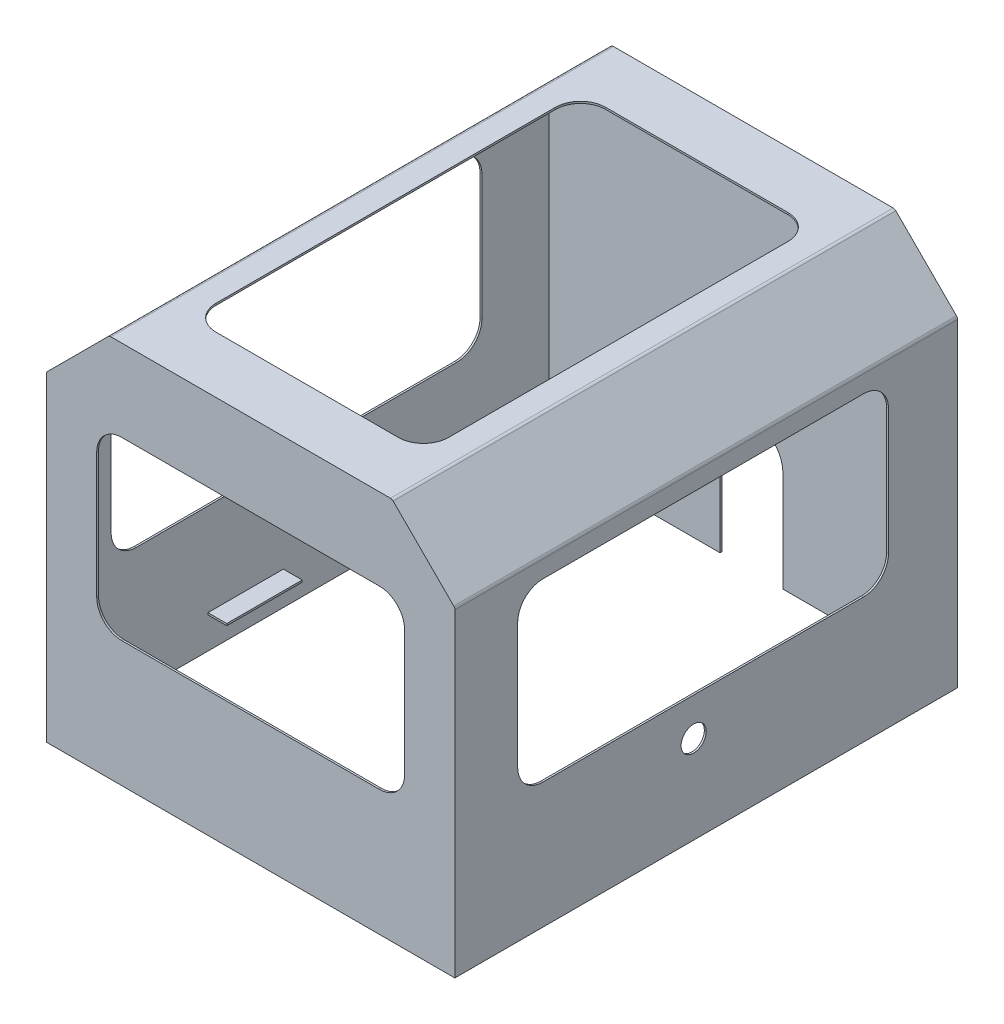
ISO-10303-21;
HEADER;
FILE_DESCRIPTION(('STEP AP214'),'2;1');
FILE_NAME('part.step','',(''),(''),'','','');
FILE_SCHEMA(('AUTOMOTIVE_DESIGN { 1 0 10303 214 1 1 1 1 }'));
ENDSEC;
DATA;
#1=APPLICATION_CONTEXT('core data for automotive mechanical design processes');
#2=APPLICATION_PROTOCOL_DEFINITION('international standard','automotive_design',2000,#1);
#3=PRODUCT_CONTEXT('',#1,'mechanical');
#4=PRODUCT('Part','Part','',(#3));
#5=PRODUCT_RELATED_PRODUCT_CATEGORY('part','',(#4));
#6=PRODUCT_DEFINITION_FORMATION('','',#4);
#7=PRODUCT_DEFINITION_CONTEXT('part definition',#1,'design');
#8=PRODUCT_DEFINITION('design','',#6,#7);
#9=PRODUCT_DEFINITION_SHAPE('','',#8);
#10=(LENGTH_UNIT() NAMED_UNIT(*) SI_UNIT(.MILLI.,.METRE.));
#11=(NAMED_UNIT(*) PLANE_ANGLE_UNIT() SI_UNIT($,.RADIAN.));
#12=(NAMED_UNIT(*) SI_UNIT($,.STERADIAN.) SOLID_ANGLE_UNIT());
#13=UNCERTAINTY_MEASURE_WITH_UNIT(LENGTH_MEASURE(1.E-05),#10,'distance_accuracy_value','');
#14=(GEOMETRIC_REPRESENTATION_CONTEXT(3) GLOBAL_UNCERTAINTY_ASSIGNED_CONTEXT((#13)) GLOBAL_UNIT_ASSIGNED_CONTEXT((#10,
#11,#12)) REPRESENTATION_CONTEXT('',''));
#15=CARTESIAN_POINT('',(0.,0.,0.));
#16=DIRECTION('',(0.,0.,1.));
#17=DIRECTION('',(1.,0.,0.));
#18=AXIS2_PLACEMENT_3D('',#15,#16,#17);
#19=CARTESIAN_POINT('',(323.5,305.,0.));
#20=DIRECTION('',(-1.,0.,0.));
#21=DIRECTION('',(0.,0.,1.));
#22=AXIS2_PLACEMENT_3D('',#19,#20,#21);
#23=PLANE('',#22);
#24=CARTESIAN_POINT('',(323.5,70.,-190.));
#25=DIRECTION('',(-1.,0.,0.));
#26=DIRECTION('',(0.,0.,1.));
#27=AXIS2_PLACEMENT_3D('',#24,#25,#26);
#28=CIRCLE('',#27,10.);
#29=CARTESIAN_POINT('',(323.5,70.,-180.));
#30=VERTEX_POINT('',#29);
#31=EDGE_CURVE('E489',#30,#30,#28,.T.);
#32=ORIENTED_EDGE('',*,*,#31,.F.);
#33=EDGE_LOOP('',(#32));
#34=FACE_BOUND('',#33,.T.);
#35=DIRECTION('',(0.,0.,-1.));
#36=VECTOR('',#35,1.);
#37=CARTESIAN_POINT('',(323.5,26.5,-232.));
#38=LINE('',#37,#36);
#39=CARTESIAN_POINT('',(323.5,26.5,-232.));
#40=VERTEX_POINT('',#39);
#41=CARTESIAN_POINT('',(323.5,26.5,-292.));
#42=VERTEX_POINT('',#41);
#43=EDGE_CURVE('E538',#40,#42,#38,.T.);
#44=ORIENTED_EDGE('',*,*,#43,.F.);
#45=DIRECTION('',(0.,1.,0.));
#46=VECTOR('',#45,1.);
#47=CARTESIAN_POINT('',(323.5,24.9999999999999,-232.));
#48=LINE('',#47,#46);
#49=CARTESIAN_POINT('',(323.5,24.9999999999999,-232.));
#50=VERTEX_POINT('',#49);
#51=EDGE_CURVE('E535',#50,#40,#48,.T.);
#52=ORIENTED_EDGE('',*,*,#51,.F.);
#53=DIRECTION('',(0.,0.,1.));
#54=VECTOR('',#53,1.);
#55=CARTESIAN_POINT('',(323.5,24.9999999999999,-232.));
#56=LINE('',#55,#54);
#57=CARTESIAN_POINT('',(323.5,24.9999999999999,-292.));
#58=VERTEX_POINT('',#57);
#59=EDGE_CURVE('E543',#58,#50,#56,.T.);
#60=ORIENTED_EDGE('',*,*,#59,.F.);
#61=DIRECTION('',(0.,-1.,0.));
#62=VECTOR('',#61,1.);
#63=CARTESIAN_POINT('',(323.5,24.9999999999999,-292.));
#64=LINE('',#63,#62);
#65=EDGE_CURVE('E540',#42,#58,#64,.T.);
#66=ORIENTED_EDGE('',*,*,#65,.F.);
#67=EDGE_LOOP('',(#44,#52,#60,#66));
#68=FACE_BOUND('',#67,.T.);
#69=CARTESIAN_POINT('',(323.5,220.,-70.));
#70=DIRECTION('',(-1.,0.,0.));
#71=DIRECTION('',(0.,0.,1.));
#72=AXIS2_PLACEMENT_3D('',#69,#70,#71);
#73=CIRCLE('',#72,20.);
#74=CARTESIAN_POINT('',(323.5,220.,-50.));
#75=VERTEX_POINT('',#74);
#76=CARTESIAN_POINT('',(323.5,240.,-70.));
#77=VERTEX_POINT('',#76);
#78=EDGE_CURVE('E11',#75,#77,#73,.T.);
#79=ORIENTED_EDGE('',*,*,#78,.F.);
#80=DIRECTION('',(0.,1.,0.));
#81=VECTOR('',#80,1.);
#82=CARTESIAN_POINT('',(323.5,305.,-50.));
#83=LINE('',#82,#81);
#84=CARTESIAN_POINT('',(323.5,120.,-50.));
#85=VERTEX_POINT('',#84);
#86=EDGE_CURVE('E997',#85,#75,#83,.T.);
#87=ORIENTED_EDGE('',*,*,#86,.F.);
#88=CARTESIAN_POINT('',(323.5,120.,-70.));
#89=DIRECTION('',(-1.,0.,0.));
#90=DIRECTION('',(0.,0.,1.));
#91=AXIS2_PLACEMENT_3D('',#88,#89,#90);
#92=CIRCLE('',#91,20.);
#93=CARTESIAN_POINT('',(323.5,100.,-70.));
#94=VERTEX_POINT('',#93);
#95=EDGE_CURVE('E999',#94,#85,#92,.T.);
#96=ORIENTED_EDGE('',*,*,#95,.F.);
#97=DIRECTION('',(0.,0.,1.));
#98=VECTOR('',#97,1.);
#99=CARTESIAN_POINT('',(323.5,100.,0.));
#100=LINE('',#99,#98);
#101=CARTESIAN_POINT('',(323.5,100.,-325.));
#102=VERTEX_POINT('',#101);
#103=EDGE_CURVE('E1002',#102,#94,#100,.T.);
#104=ORIENTED_EDGE('',*,*,#103,.F.);
#105=CARTESIAN_POINT('',(323.5,120.,-325.));
#106=DIRECTION('',(-1.,0.,0.));
#107=DIRECTION('',(0.,0.,1.));
#108=AXIS2_PLACEMENT_3D('',#105,#106,#107);
#109=CIRCLE('',#108,20.);
#110=CARTESIAN_POINT('',(323.5,120.,-345.));
#111=VERTEX_POINT('',#110);
#112=EDGE_CURVE('E1004',#111,#102,#109,.T.);
#113=ORIENTED_EDGE('',*,*,#112,.F.);
#114=DIRECTION('',(0.,-1.,0.));
#115=VECTOR('',#114,1.);
#116=CARTESIAN_POINT('',(323.5,305.,-345.));
#117=LINE('',#116,#115);
#118=CARTESIAN_POINT('',(323.5,220.,-345.));
#119=VERTEX_POINT('',#118);
#120=EDGE_CURVE('E1006',#119,#111,#117,.T.);
#121=ORIENTED_EDGE('',*,*,#120,.F.);
#122=CARTESIAN_POINT('',(323.5,220.,-325.));
#123=DIRECTION('',(-1.,0.,0.));
#124=DIRECTION('',(0.,0.,1.));
#125=AXIS2_PLACEMENT_3D('',#122,#123,#124);
#126=CIRCLE('',#125,20.);
#127=CARTESIAN_POINT('',(323.5,240.,-325.));
#128=VERTEX_POINT('',#127);
#129=EDGE_CURVE('E1008',#128,#119,#126,.T.);
#130=ORIENTED_EDGE('',*,*,#129,.F.);
#131=DIRECTION('',(0.,0.,-1.));
#132=VECTOR('',#131,1.);
#133=CARTESIAN_POINT('',(323.5,240.,0.));
#134=LINE('',#133,#132);
#135=EDGE_CURVE('E32',#77,#128,#134,.T.);
#136=ORIENTED_EDGE('',*,*,#135,.F.);
#137=EDGE_LOOP('',(#79,#87,#96,#104,#113,#121,#130,#136));
#138=FACE_BOUND('',#137,.T.);
#139=DIRECTION('',(0.,-1.,0.));
#140=VECTOR('',#139,1.);
#141=CARTESIAN_POINT('',(323.5,305.,-398.5));
#142=LINE('',#141,#140);
#143=CARTESIAN_POINT('',(323.5,253.757359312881,-398.5));
#144=VERTEX_POINT('',#143);
#145=CARTESIAN_POINT('',(323.5,0.,-398.5));
#146=VERTEX_POINT('',#145);
#147=EDGE_CURVE('E858',#144,#146,#142,.T.);
#148=ORIENTED_EDGE('',*,*,#147,.T.);
#149=DIRECTION('',(0.,0.,-1.));
#150=VECTOR('',#149,1.);
#151=CARTESIAN_POINT('',(323.5,0.,-400.));
#152=LINE('',#151,#150);
#153=CARTESIAN_POINT('',(323.5,0.,-1.5));
#154=VERTEX_POINT('',#153);
#155=EDGE_CURVE('E918',#154,#146,#152,.T.);
#156=ORIENTED_EDGE('',*,*,#155,.F.);
#157=DIRECTION('',(0.,-1.,0.));
#158=VECTOR('',#157,1.);
#159=CARTESIAN_POINT('',(323.5,305.,-1.5));
#160=LINE('',#159,#158);
#161=CARTESIAN_POINT('',(323.5,253.757359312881,-1.5));
#162=VERTEX_POINT('',#161);
#163=EDGE_CURVE('E849',#162,#154,#160,.T.);
#164=ORIENTED_EDGE('',*,*,#163,.F.);
#165=DIRECTION('',(0.,0.,1.));
#166=VECTOR('',#165,1.);
#167=CARTESIAN_POINT('',(323.5,253.757359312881,0.));
#168=LINE('',#167,#166);
#169=EDGE_CURVE('E883',#144,#162,#168,.T.);
#170=ORIENTED_EDGE('',*,*,#169,.F.);
#171=EDGE_LOOP('',(#148,#156,#164,#170));
#172=FACE_BOUND('',#171,.T.);
#173=DIRECTION('',(0.,0.,-1.));
#174=VECTOR('',#173,1.);
#175=CARTESIAN_POINT('',(323.5,26.5,-127.029251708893));
#176=LINE('',#175,#174);
#177=CARTESIAN_POINT('',(323.5,26.5,-127.029251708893));
#178=VERTEX_POINT('',#177);
#179=CARTESIAN_POINT('',(323.5,26.5,-187.));
#180=VERTEX_POINT('',#179);
#181=EDGE_CURVE('E511',#178,#180,#176,.T.);
#182=ORIENTED_EDGE('',*,*,#181,.F.);
#183=DIRECTION('',(0.,0.999809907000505,-0.019497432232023));
#184=VECTOR('',#183,1.);
#185=CARTESIAN_POINT('',(323.5,24.9999999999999,-127.));
#186=LINE('',#185,#184);
#187=CARTESIAN_POINT('',(323.5,24.9999999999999,-127.));
#188=VERTEX_POINT('',#187);
#189=EDGE_CURVE('E504',#188,#178,#186,.T.);
#190=ORIENTED_EDGE('',*,*,#189,.F.);
#191=DIRECTION('',(0.,0.,1.));
#192=VECTOR('',#191,1.);
#193=CARTESIAN_POINT('',(323.5,24.9999999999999,-127.));
#194=LINE('',#193,#192);
#195=CARTESIAN_POINT('',(323.5,24.9999999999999,-186.970704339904));
#196=VERTEX_POINT('',#195);
#197=EDGE_CURVE('E515',#196,#188,#194,.T.);
#198=ORIENTED_EDGE('',*,*,#197,.F.);
#199=DIRECTION('',(0.,-0.99980933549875,0.0195267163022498));
#200=VECTOR('',#199,1.);
#201=CARTESIAN_POINT('',(323.5,24.9999999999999,-186.970704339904));
#202=LINE('',#201,#200);
#203=EDGE_CURVE('E513',#180,#196,#202,.T.);
#204=ORIENTED_EDGE('',*,*,#203,.F.);
#205=EDGE_LOOP('',(#182,#190,#198,#204));
#206=FACE_BOUND('',#205,.T.);
#207=ADVANCED_FACE('F24',(#34,#68,#138,#172,#206),#23,.T.);
#208=CARTESIAN_POINT('',(1.50000000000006,305.,0.));
#209=DIRECTION('',(1.,0.,0.));
#210=DIRECTION('',(0.,0.,-1.));
#211=AXIS2_PLACEMENT_3D('',#208,#209,#210);
#212=PLANE('',#211);
#213=CARTESIAN_POINT('',(1.50000000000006,70.,-190.));
#214=DIRECTION('',(1.,0.,0.));
#215=DIRECTION('',(0.,0.,-1.));
#216=AXIS2_PLACEMENT_3D('',#213,#214,#215);
#217=CIRCLE('',#216,10.);
#218=CARTESIAN_POINT('',(1.50000000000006,70.,-200.));
#219=VERTEX_POINT('',#218);
#220=EDGE_CURVE('E1653',#219,#219,#217,.T.);
#221=ORIENTED_EDGE('',*,*,#220,.F.);
#222=EDGE_LOOP('',(#221));
#223=FACE_BOUND('',#222,.T.);
#224=DIRECTION('',(0.,0.,-1.));
#225=VECTOR('',#224,1.);
#226=CARTESIAN_POINT('',(1.50000000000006,24.9999999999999,-232.));
#227=LINE('',#226,#225);
#228=CARTESIAN_POINT('',(1.50000000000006,24.9999999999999,-232.));
#229=VERTEX_POINT('',#228);
#230=CARTESIAN_POINT('',(1.50000000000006,24.9999999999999,-292.));
#231=VERTEX_POINT('',#230);
#232=EDGE_CURVE('E596',#229,#231,#227,.T.);
#233=ORIENTED_EDGE('',*,*,#232,.F.);
#234=DIRECTION('',(0.,-1.,0.));
#235=VECTOR('',#234,1.);
#236=CARTESIAN_POINT('',(1.50000000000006,26.5,-232.));
#237=LINE('',#236,#235);
#238=CARTESIAN_POINT('',(1.50000000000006,26.5,-232.));
#239=VERTEX_POINT('',#238);
#240=EDGE_CURVE('E593',#239,#229,#237,.T.);
#241=ORIENTED_EDGE('',*,*,#240,.F.);
#242=DIRECTION('',(0.,0.,1.));
#243=VECTOR('',#242,1.);
#244=CARTESIAN_POINT('',(1.50000000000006,26.5,-232.));
#245=LINE('',#244,#243);
#246=CARTESIAN_POINT('',(1.50000000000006,26.5,-292.));
#247=VERTEX_POINT('',#246);
#248=EDGE_CURVE('E601',#247,#239,#245,.T.);
#249=ORIENTED_EDGE('',*,*,#248,.F.);
#250=DIRECTION('',(0.,1.,0.));
#251=VECTOR('',#250,1.);
#252=CARTESIAN_POINT('',(1.50000000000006,26.5,-292.));
#253=LINE('',#252,#251);
#254=EDGE_CURVE('E598',#231,#247,#253,.T.);
#255=ORIENTED_EDGE('',*,*,#254,.F.);
#256=EDGE_LOOP('',(#233,#241,#249,#255));
#257=FACE_BOUND('',#256,.T.);
#258=CARTESIAN_POINT('',(1.50000000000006,220.,-70.));
#259=DIRECTION('',(1.,0.,0.));
#260=DIRECTION('',(0.,0.,-1.));
#261=AXIS2_PLACEMENT_3D('',#258,#259,#260);
#262=CIRCLE('',#261,20.);
#263=CARTESIAN_POINT('',(1.50000000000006,240.,-70.));
#264=VERTEX_POINT('',#263);
#265=CARTESIAN_POINT('',(1.50000000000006,220.,-50.));
#266=VERTEX_POINT('',#265);
#267=EDGE_CURVE('E714',#264,#266,#262,.T.);
#268=ORIENTED_EDGE('',*,*,#267,.F.);
#269=DIRECTION('',(0.,0.,1.));
#270=VECTOR('',#269,1.);
#271=CARTESIAN_POINT('',(1.50000000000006,240.,0.));
#272=LINE('',#271,#270);
#273=CARTESIAN_POINT('',(1.50000000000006,240.,-325.));
#274=VERTEX_POINT('',#273);
#275=EDGE_CURVE('E712',#274,#264,#272,.T.);
#276=ORIENTED_EDGE('',*,*,#275,.F.);
#277=CARTESIAN_POINT('',(1.50000000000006,220.,-325.));
#278=DIRECTION('',(1.,0.,0.));
#279=DIRECTION('',(0.,0.,-1.));
#280=AXIS2_PLACEMENT_3D('',#277,#278,#279);
#281=CIRCLE('',#280,20.);
#282=CARTESIAN_POINT('',(1.50000000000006,220.,-345.));
#283=VERTEX_POINT('',#282);
#284=EDGE_CURVE('E710',#283,#274,#281,.T.);
#285=ORIENTED_EDGE('',*,*,#284,.F.);
#286=DIRECTION('',(0.,1.,0.));
#287=VECTOR('',#286,1.);
#288=CARTESIAN_POINT('',(1.50000000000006,305.,-345.));
#289=LINE('',#288,#287);
#290=CARTESIAN_POINT('',(1.50000000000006,120.,-345.));
#291=VERTEX_POINT('',#290);
#292=EDGE_CURVE('E708',#291,#283,#289,.T.);
#293=ORIENTED_EDGE('',*,*,#292,.F.);
#294=CARTESIAN_POINT('',(1.50000000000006,120.,-325.));
#295=DIRECTION('',(1.,0.,0.));
#296=DIRECTION('',(0.,0.,-1.));
#297=AXIS2_PLACEMENT_3D('',#294,#295,#296);
#298=CIRCLE('',#297,20.);
#299=CARTESIAN_POINT('',(1.50000000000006,100.,-325.));
#300=VERTEX_POINT('',#299);
#301=EDGE_CURVE('E706',#300,#291,#298,.T.);
#302=ORIENTED_EDGE('',*,*,#301,.F.);
#303=DIRECTION('',(0.,0.,-1.));
#304=VECTOR('',#303,1.);
#305=CARTESIAN_POINT('',(1.50000000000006,100.,0.));
#306=LINE('',#305,#304);
#307=CARTESIAN_POINT('',(1.50000000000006,100.,-70.));
#308=VERTEX_POINT('',#307);
#309=EDGE_CURVE('E704',#308,#300,#306,.T.);
#310=ORIENTED_EDGE('',*,*,#309,.F.);
#311=CARTESIAN_POINT('',(1.50000000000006,120.,-70.));
#312=DIRECTION('',(1.,0.,0.));
#313=DIRECTION('',(0.,0.,-1.));
#314=AXIS2_PLACEMENT_3D('',#311,#312,#313);
#315=CIRCLE('',#314,20.);
#316=CARTESIAN_POINT('',(1.50000000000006,120.,-50.));
#317=VERTEX_POINT('',#316);
#318=EDGE_CURVE('E702',#317,#308,#315,.T.);
#319=ORIENTED_EDGE('',*,*,#318,.F.);
#320=DIRECTION('',(0.,-1.,0.));
#321=VECTOR('',#320,1.);
#322=CARTESIAN_POINT('',(1.50000000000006,305.,-50.));
#323=LINE('',#322,#321);
#324=EDGE_CURVE('E673',#266,#317,#323,.T.);
#325=ORIENTED_EDGE('',*,*,#324,.F.);
#326=EDGE_LOOP('',(#268,#276,#285,#293,#302,#310,#319,#325));
#327=FACE_BOUND('',#326,.T.);
#328=DIRECTION('',(0.,-1.,0.));
#329=VECTOR('',#328,1.);
#330=CARTESIAN_POINT('',(1.50000000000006,305.,-1.5));
#331=LINE('',#330,#329);
#332=CARTESIAN_POINT('',(1.50000000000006,253.757359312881,-1.5));
#333=VERTEX_POINT('',#332);
#334=CARTESIAN_POINT('',(1.50000000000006,0.,-1.5));
#335=VERTEX_POINT('',#334);
#336=EDGE_CURVE('E846',#333,#335,#331,.T.);
#337=ORIENTED_EDGE('',*,*,#336,.T.);
#338=DIRECTION('',(0.,0.,1.));
#339=VECTOR('',#338,1.);
#340=CARTESIAN_POINT('',(1.50000000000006,0.,-400.));
#341=LINE('',#340,#339);
#342=CARTESIAN_POINT('',(1.50000000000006,0.,-398.5));
#343=VERTEX_POINT('',#342);
#344=EDGE_CURVE('E831',#343,#335,#341,.T.);
#345=ORIENTED_EDGE('',*,*,#344,.F.);
#346=DIRECTION('',(0.,-1.,0.));
#347=VECTOR('',#346,1.);
#348=CARTESIAN_POINT('',(1.50000000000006,305.,-398.5));
#349=LINE('',#348,#347);
#350=CARTESIAN_POINT('',(1.50000000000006,253.757359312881,-398.5));
#351=VERTEX_POINT('',#350);
#352=EDGE_CURVE('E855',#351,#343,#349,.T.);
#353=ORIENTED_EDGE('',*,*,#352,.F.);
#354=DIRECTION('',(0.,0.,-1.));
#355=VECTOR('',#354,1.);
#356=CARTESIAN_POINT('',(1.50000000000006,253.757359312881,0.));
#357=LINE('',#356,#355);
#358=EDGE_CURVE('E850',#333,#351,#357,.T.);
#359=ORIENTED_EDGE('',*,*,#358,.F.);
#360=EDGE_LOOP('',(#337,#345,#353,#359));
#361=FACE_BOUND('',#360,.T.);
#362=DIRECTION('',(0.,0.,-1.));
#363=VECTOR('',#362,1.);
#364=CARTESIAN_POINT('',(1.50000000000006,24.9999999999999,-127.));
#365=LINE('',#364,#363);
#366=CARTESIAN_POINT('',(1.50000000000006,24.9999999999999,-127.));
#367=VERTEX_POINT('',#366);
#368=CARTESIAN_POINT('',(1.50000000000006,24.9999999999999,-187.));
#369=VERTEX_POINT('',#368);
#370=EDGE_CURVE('E567',#367,#369,#365,.T.);
#371=ORIENTED_EDGE('',*,*,#370,.F.);
#372=DIRECTION('',(0.,-1.,0.));
#373=VECTOR('',#372,1.);
#374=CARTESIAN_POINT('',(1.50000000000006,26.5,-127.));
#375=LINE('',#374,#373);
#376=CARTESIAN_POINT('',(1.50000000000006,26.5,-127.));
#377=VERTEX_POINT('',#376);
#378=EDGE_CURVE('E564',#377,#367,#375,.T.);
#379=ORIENTED_EDGE('',*,*,#378,.F.);
#380=DIRECTION('',(0.,0.,1.));
#381=VECTOR('',#380,1.);
#382=CARTESIAN_POINT('',(1.50000000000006,26.5,-127.));
#383=LINE('',#382,#381);
#384=CARTESIAN_POINT('',(1.50000000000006,26.5,-187.));
#385=VERTEX_POINT('',#384);
#386=EDGE_CURVE('E572',#385,#377,#383,.T.);
#387=ORIENTED_EDGE('',*,*,#386,.F.);
#388=DIRECTION('',(0.,1.,0.));
#389=VECTOR('',#388,1.);
#390=CARTESIAN_POINT('',(1.50000000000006,26.5,-187.));
#391=LINE('',#390,#389);
#392=EDGE_CURVE('E569',#369,#385,#391,.T.);
#393=ORIENTED_EDGE('',*,*,#392,.F.);
#394=EDGE_LOOP('',(#371,#379,#387,#393));
#395=FACE_BOUND('',#394,.T.);
#396=ADVANCED_FACE('F1068',(#223,#257,#327,#361,#395),#212,.T.);
#397=CARTESIAN_POINT('',(0.,0.,-400.));
#398=DIRECTION('',(0.,-1.,0.));
#399=DIRECTION('',(0.,0.,-1.));
#400=AXIS2_PLACEMENT_3D('',#397,#398,#399);
#401=PLANE('',#400);
#402=DIRECTION('',(0.,0.,-1.));
#403=VECTOR('',#402,1.);
#404=CARTESIAN_POINT('',(187.5,0.,-398.5));
#405=LINE('',#404,#403);
#406=CARTESIAN_POINT('',(187.5,0.,-398.5));
#407=VERTEX_POINT('',#406);
#408=CARTESIAN_POINT('',(187.5,0.,-400.));
#409=VERTEX_POINT('',#408);
#410=EDGE_CURVE('E505',#407,#409,#405,.T.);
#411=ORIENTED_EDGE('',*,*,#410,.T.);
#412=DIRECTION('',(-1.,0.,0.));
#413=VECTOR('',#412,1.);
#414=CARTESIAN_POINT('',(0.,0.,-400.));
#415=LINE('',#414,#413);
#416=CARTESIAN_POINT('',(325.,0.,-400.));
#417=VERTEX_POINT('',#416);
#418=EDGE_CURVE('E932',#417,#409,#415,.T.);
#419=ORIENTED_EDGE('',*,*,#418,.F.);
#420=DIRECTION('',(0.,0.,-1.));
#421=VECTOR('',#420,1.);
#422=CARTESIAN_POINT('',(325.,0.,0.));
#423=LINE('',#422,#421);
#424=CARTESIAN_POINT('',(325.,0.,0.));
#425=VERTEX_POINT('',#424);
#426=EDGE_CURVE('E928',#425,#417,#423,.T.);
#427=ORIENTED_EDGE('',*,*,#426,.F.);
#428=DIRECTION('',(1.,0.,0.));
#429=VECTOR('',#428,1.);
#430=CARTESIAN_POINT('',(0.,0.,0.));
#431=LINE('',#430,#429);
#432=CARTESIAN_POINT('',(0.,0.,0.));
#433=VERTEX_POINT('',#432);
#434=EDGE_CURVE('E925',#433,#425,#431,.T.);
#435=ORIENTED_EDGE('',*,*,#434,.F.);
#436=DIRECTION('',(0.,0.,1.));
#437=VECTOR('',#436,1.);
#438=CARTESIAN_POINT('',(0.,0.,0.));
#439=LINE('',#438,#437);
#440=CARTESIAN_POINT('',(0.,0.,-400.));
#441=VERTEX_POINT('',#440);
#442=EDGE_CURVE('E911',#441,#433,#439,.T.);
#443=ORIENTED_EDGE('',*,*,#442,.F.);
#444=CARTESIAN_POINT('',(137.5,0.,-400.));
#445=VERTEX_POINT('',#444);
#446=EDGE_CURVE('E931',#445,#441,#415,.T.);
#447=ORIENTED_EDGE('',*,*,#446,.F.);
#448=DIRECTION('',(0.,0.,-1.));
#449=VECTOR('',#448,1.);
#450=CARTESIAN_POINT('',(137.5,0.,-398.5));
#451=LINE('',#450,#449);
#452=CARTESIAN_POINT('',(137.5,0.,-398.5));
#453=VERTEX_POINT('',#452);
#454=EDGE_CURVE('E486',#453,#445,#451,.T.);
#455=ORIENTED_EDGE('',*,*,#454,.F.);
#456=DIRECTION('',(-1.,0.,0.));
#457=VECTOR('',#456,1.);
#458=CARTESIAN_POINT('',(0.,0.,-398.5));
#459=LINE('',#458,#457);
#460=EDGE_CURVE('E917',#453,#343,#459,.T.);
#461=ORIENTED_EDGE('',*,*,#460,.T.);
#462=ORIENTED_EDGE('',*,*,#344,.T.);
#463=DIRECTION('',(1.,0.,0.));
#464=VECTOR('',#463,1.);
#465=CARTESIAN_POINT('',(0.,0.,-1.5));
#466=LINE('',#465,#464);
#467=EDGE_CURVE('E914',#335,#154,#466,.T.);
#468=ORIENTED_EDGE('',*,*,#467,.T.);
#469=ORIENTED_EDGE('',*,*,#155,.T.);
#470=EDGE_CURVE('E880',#146,#407,#459,.T.);
#471=ORIENTED_EDGE('',*,*,#470,.T.);
#472=EDGE_LOOP('',(#411,#419,#427,#435,#443,#447,#455,#461,#462,#468,#469,#471));
#473=FACE_BOUND('',#472,.T.);
#474=ADVANCED_FACE('F1074',(#473),#401,.T.);
#475=CARTESIAN_POINT('',(0.,305.,0.));
#476=DIRECTION('',(1.,0.,0.));
#477=DIRECTION('',(0.,0.,-1.));
#478=AXIS2_PLACEMENT_3D('',#475,#476,#477);
#479=PLANE('',#478);
#480=CARTESIAN_POINT('',(0.,70.,-190.));
#481=DIRECTION('',(-1.,0.,0.));
#482=DIRECTION('',(0.,0.,1.));
#483=AXIS2_PLACEMENT_3D('',#480,#481,#482);
#484=CIRCLE('',#483,10.);
#485=CARTESIAN_POINT('',(0.,70.,-180.));
#486=VERTEX_POINT('',#485);
#487=EDGE_CURVE('E1656',#486,#486,#484,.T.);
#488=ORIENTED_EDGE('',*,*,#487,.F.);
#489=EDGE_LOOP('',(#488));
#490=FACE_BOUND('',#489,.T.);
#491=DIRECTION('',(0.,0.,1.));
#492=VECTOR('',#491,1.);
#493=CARTESIAN_POINT('',(0.,240.,-70.));
#494=LINE('',#493,#492);
#495=CARTESIAN_POINT('',(0.,240.,-325.));
#496=VERTEX_POINT('',#495);
#497=CARTESIAN_POINT('',(0.,240.,-70.));
#498=VERTEX_POINT('',#497);
#499=EDGE_CURVE('E666',#496,#498,#494,.T.);
#500=ORIENTED_EDGE('',*,*,#499,.T.);
#501=CARTESIAN_POINT('',(0.,220.,-70.));
#502=DIRECTION('',(1.,0.,0.));
#503=DIRECTION('',(0.,0.,-1.));
#504=AXIS2_PLACEMENT_3D('',#501,#502,#503);
#505=CIRCLE('',#504,20.);
#506=CARTESIAN_POINT('',(0.,220.,-50.));
#507=VERTEX_POINT('',#506);
#508=EDGE_CURVE('E645',#498,#507,#505,.T.);
#509=ORIENTED_EDGE('',*,*,#508,.T.);
#510=DIRECTION('',(0.,-1.,0.));
#511=VECTOR('',#510,1.);
#512=CARTESIAN_POINT('',(0.,220.,-50.));
#513=LINE('',#512,#511);
#514=CARTESIAN_POINT('',(0.,120.,-50.));
#515=VERTEX_POINT('',#514);
#516=EDGE_CURVE('E648',#507,#515,#513,.T.);
#517=ORIENTED_EDGE('',*,*,#516,.T.);
#518=CARTESIAN_POINT('',(0.,120.,-70.));
#519=DIRECTION('',(1.,0.,0.));
#520=DIRECTION('',(0.,0.,-1.));
#521=AXIS2_PLACEMENT_3D('',#518,#519,#520);
#522=CIRCLE('',#521,20.);
#523=CARTESIAN_POINT('',(0.,100.,-70.));
#524=VERTEX_POINT('',#523);
#525=EDGE_CURVE('E651',#515,#524,#522,.T.);
#526=ORIENTED_EDGE('',*,*,#525,.T.);
#527=DIRECTION('',(0.,0.,-1.));
#528=VECTOR('',#527,1.);
#529=CARTESIAN_POINT('',(0.,100.,-70.));
#530=LINE('',#529,#528);
#531=CARTESIAN_POINT('',(0.,100.,-325.));
#532=VERTEX_POINT('',#531);
#533=EDGE_CURVE('E654',#524,#532,#530,.T.);
#534=ORIENTED_EDGE('',*,*,#533,.T.);
#535=CARTESIAN_POINT('',(0.,120.,-325.));
#536=DIRECTION('',(1.,0.,0.));
#537=DIRECTION('',(0.,0.,-1.));
#538=AXIS2_PLACEMENT_3D('',#535,#536,#537);
#539=CIRCLE('',#538,20.);
#540=CARTESIAN_POINT('',(0.,120.,-345.));
#541=VERTEX_POINT('',#540);
#542=EDGE_CURVE('E657',#532,#541,#539,.T.);
#543=ORIENTED_EDGE('',*,*,#542,.T.);
#544=DIRECTION('',(0.,1.,0.));
#545=VECTOR('',#544,1.);
#546=CARTESIAN_POINT('',(0.,220.,-345.));
#547=LINE('',#546,#545);
#548=CARTESIAN_POINT('',(0.,220.,-345.));
#549=VERTEX_POINT('',#548);
#550=EDGE_CURVE('E660',#541,#549,#547,.T.);
#551=ORIENTED_EDGE('',*,*,#550,.T.);
#552=CARTESIAN_POINT('',(0.,220.,-325.));
#553=DIRECTION('',(1.,0.,0.));
#554=DIRECTION('',(0.,0.,-1.));
#555=AXIS2_PLACEMENT_3D('',#552,#553,#554);
#556=CIRCLE('',#555,20.);
#557=EDGE_CURVE('E663',#549,#496,#556,.T.);
#558=ORIENTED_EDGE('',*,*,#557,.T.);
#559=EDGE_LOOP('',(#500,#509,#517,#526,#534,#543,#551,#558));
#560=FACE_BOUND('',#559,.T.);
#561=DIRECTION('',(0.,-1.,0.));
#562=VECTOR('',#561,1.);
#563=CARTESIAN_POINT('',(0.,305.,0.));
#564=LINE('',#563,#562);
#565=CARTESIAN_POINT('',(0.,253.757359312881,0.));
#566=VERTEX_POINT('',#565);
#567=EDGE_CURVE('E947',#566,#433,#564,.T.);
#568=ORIENTED_EDGE('',*,*,#567,.F.);
#569=DIRECTION('',(0.,0.,1.));
#570=VECTOR('',#569,1.);
#571=CARTESIAN_POINT('',(0.,253.757359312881,-400.));
#572=LINE('',#571,#570);
#573=CARTESIAN_POINT('',(0.,253.757359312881,-400.));
#574=VERTEX_POINT('',#573);
#575=EDGE_CURVE('E961',#566,#574,#572,.F.);
#576=ORIENTED_EDGE('',*,*,#575,.T.);
#577=DIRECTION('',(0.,-1.,0.));
#578=VECTOR('',#577,1.);
#579=CARTESIAN_POINT('',(0.,305.,-400.));
#580=LINE('',#579,#578);
#581=EDGE_CURVE('E940',#574,#441,#580,.T.);
#582=ORIENTED_EDGE('',*,*,#581,.T.);
#583=ORIENTED_EDGE('',*,*,#442,.T.);
#584=EDGE_LOOP('',(#568,#576,#582,#583));
#585=FACE_BOUND('',#584,.T.);
#586=ADVANCED_FACE('F26',(#490,#560,#585),#479,.F.);
#587=CARTESIAN_POINT('',(0.,305.,0.));
#588=DIRECTION('',(0.,0.,-1.));
#589=DIRECTION('',(-1.,0.,0.));
#590=AXIS2_PLACEMENT_3D('',#587,#588,#589);
#591=PLANE('',#590);
#592=DIRECTION('',(-1.,0.,0.));
#593=VECTOR('',#592,1.);
#594=CARTESIAN_POINT('',(60.0000000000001,240.,0.));
#595=LINE('',#594,#593);
#596=CARTESIAN_POINT('',(265.,240.,0.));
#597=VERTEX_POINT('',#596);
#598=CARTESIAN_POINT('',(60.0000000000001,240.,0.));
#599=VERTEX_POINT('',#598);
#600=EDGE_CURVE('E719',#597,#599,#595,.T.);
#601=ORIENTED_EDGE('',*,*,#600,.F.);
#602=CARTESIAN_POINT('',(265.,220.,0.));
#603=DIRECTION('',(0.,0.,1.));
#604=DIRECTION('',(1.,0.,0.));
#605=AXIS2_PLACEMENT_3D('',#602,#603,#604);
#606=CIRCLE('',#605,20.);
#607=CARTESIAN_POINT('',(285.,220.,0.));
#608=VERTEX_POINT('',#607);
#609=EDGE_CURVE('E717',#608,#597,#606,.T.);
#610=ORIENTED_EDGE('',*,*,#609,.F.);
#611=DIRECTION('',(0.,1.,0.));
#612=VECTOR('',#611,1.);
#613=CARTESIAN_POINT('',(285.,220.,0.));
#614=LINE('',#613,#612);
#615=CARTESIAN_POINT('',(285.,120.,0.));
#616=VERTEX_POINT('',#615);
#617=EDGE_CURVE('E737',#616,#608,#614,.T.);
#618=ORIENTED_EDGE('',*,*,#617,.F.);
#619=CARTESIAN_POINT('',(265.,120.,0.));
#620=DIRECTION('',(0.,0.,1.));
#621=DIRECTION('',(1.,0.,0.));
#622=AXIS2_PLACEMENT_3D('',#619,#620,#621);
#623=CIRCLE('',#622,20.);
#624=CARTESIAN_POINT('',(265.,100.,0.));
#625=VERTEX_POINT('',#624);
#626=EDGE_CURVE('E734',#625,#616,#623,.T.);
#627=ORIENTED_EDGE('',*,*,#626,.F.);
#628=DIRECTION('',(1.,0.,0.));
#629=VECTOR('',#628,1.);
#630=CARTESIAN_POINT('',(265.,100.,0.));
#631=LINE('',#630,#629);
#632=CARTESIAN_POINT('',(60.0000000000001,100.,0.));
#633=VERTEX_POINT('',#632);
#634=EDGE_CURVE('E731',#633,#625,#631,.T.);
#635=ORIENTED_EDGE('',*,*,#634,.F.);
#636=CARTESIAN_POINT('',(60.0000000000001,120.,0.));
#637=DIRECTION('',(0.,0.,1.));
#638=DIRECTION('',(1.,0.,0.));
#639=AXIS2_PLACEMENT_3D('',#636,#637,#638);
#640=CIRCLE('',#639,20.);
#641=CARTESIAN_POINT('',(40.,120.,0.));
#642=VERTEX_POINT('',#641);
#643=EDGE_CURVE('E728',#642,#633,#640,.T.);
#644=ORIENTED_EDGE('',*,*,#643,.F.);
#645=DIRECTION('',(0.,-1.,0.));
#646=VECTOR('',#645,1.);
#647=CARTESIAN_POINT('',(40.,220.,0.));
#648=LINE('',#647,#646);
#649=CARTESIAN_POINT('',(40.,220.,0.));
#650=VERTEX_POINT('',#649);
#651=EDGE_CURVE('E725',#650,#642,#648,.T.);
#652=ORIENTED_EDGE('',*,*,#651,.F.);
#653=CARTESIAN_POINT('',(60.0000000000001,220.,0.));
#654=DIRECTION('',(0.,0.,1.));
#655=DIRECTION('',(1.,0.,0.));
#656=AXIS2_PLACEMENT_3D('',#653,#654,#655);
#657=CIRCLE('',#656,20.);
#658=EDGE_CURVE('E722',#599,#650,#657,.T.);
#659=ORIENTED_EDGE('',*,*,#658,.F.);
#660=EDGE_LOOP('',(#601,#610,#618,#627,#635,#644,#652,#659));
#661=FACE_BOUND('',#660,.T.);
#662=DIRECTION('',(0.707106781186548,0.707106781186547,0.));
#663=VECTOR('',#662,1.);
#664=CARTESIAN_POINT('',(49.9999999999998,305.,0.));
#665=LINE('',#664,#663);
#666=CARTESIAN_POINT('',(49.1213203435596,304.12132034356,0.));
#667=VERTEX_POINT('',#666);
#668=CARTESIAN_POINT('',(0.878679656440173,255.87867965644,0.));
#669=VERTEX_POINT('',#668);
#670=EDGE_CURVE('E952',#667,#669,#665,.F.);
#671=ORIENTED_EDGE('',*,*,#670,.T.);
#672=CARTESIAN_POINT('',(3.00000000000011,253.757359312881,0.));
#673=DIRECTION('',(0.,0.,-1.));
#674=DIRECTION('',(-1.,0.,0.));
#675=AXIS2_PLACEMENT_3D('',#672,#673,#674);
#676=CIRCLE('',#675,3.);
#677=EDGE_CURVE('E982',#669,#566,#676,.F.);
#678=ORIENTED_EDGE('',*,*,#677,.T.);
#679=ORIENTED_EDGE('',*,*,#567,.T.);
#680=ORIENTED_EDGE('',*,*,#434,.T.);
#681=DIRECTION('',(0.,-1.,0.));
#682=VECTOR('',#681,1.);
#683=CARTESIAN_POINT('',(325.,305.,0.));
#684=LINE('',#683,#682);
#685=CARTESIAN_POINT('',(325.,253.757359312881,0.));
#686=VERTEX_POINT('',#685);
#687=EDGE_CURVE('E945',#686,#425,#684,.T.);
#688=ORIENTED_EDGE('',*,*,#687,.F.);
#689=CARTESIAN_POINT('',(322.,253.757359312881,0.));
#690=DIRECTION('',(0.,0.,-1.));
#691=DIRECTION('',(-1.,0.,0.));
#692=AXIS2_PLACEMENT_3D('',#689,#690,#691);
#693=CIRCLE('',#692,3.);
#694=CARTESIAN_POINT('',(324.12132034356,255.87867965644,0.));
#695=VERTEX_POINT('',#694);
#696=EDGE_CURVE('E978',#686,#695,#693,.F.);
#697=ORIENTED_EDGE('',*,*,#696,.T.);
#698=DIRECTION('',(0.707106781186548,-0.707106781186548,0.));
#699=VECTOR('',#698,1.);
#700=CARTESIAN_POINT('',(275.,305.,0.));
#701=LINE('',#700,#699);
#702=CARTESIAN_POINT('',(275.878679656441,304.12132034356,0.));
#703=VERTEX_POINT('',#702);
#704=EDGE_CURVE('E949',#695,#703,#701,.F.);
#705=ORIENTED_EDGE('',*,*,#704,.T.);
#706=CARTESIAN_POINT('',(273.757359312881,302.,0.));
#707=DIRECTION('',(0.,0.,-1.));
#708=DIRECTION('',(-1.,0.,0.));
#709=AXIS2_PLACEMENT_3D('',#706,#707,#708);
#710=CIRCLE('',#709,3.);
#711=CARTESIAN_POINT('',(273.757359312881,305.,0.));
#712=VERTEX_POINT('',#711);
#713=EDGE_CURVE('E976',#703,#712,#710,.F.);
#714=ORIENTED_EDGE('',*,*,#713,.T.);
#715=DIRECTION('',(1.,0.,0.));
#716=VECTOR('',#715,1.);
#717=CARTESIAN_POINT('',(0.,305.,0.));
#718=LINE('',#717,#716);
#719=CARTESIAN_POINT('',(51.2426406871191,305.,0.));
#720=VERTEX_POINT('',#719);
#721=EDGE_CURVE('E934',#720,#712,#718,.T.);
#722=ORIENTED_EDGE('',*,*,#721,.F.);
#723=CARTESIAN_POINT('',(51.2426406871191,302.,0.));
#724=DIRECTION('',(0.,0.,-1.));
#725=DIRECTION('',(-1.,0.,0.));
#726=AXIS2_PLACEMENT_3D('',#723,#724,#725);
#727=CIRCLE('',#726,3.);
#728=EDGE_CURVE('E980',#720,#667,#727,.F.);
#729=ORIENTED_EDGE('',*,*,#728,.T.);
#730=EDGE_LOOP('',(#671,#678,#679,#680,#688,#697,#705,#714,#722,#729));
#731=FACE_BOUND('',#730,.T.);
#732=ADVANCED_FACE('F1149',(#661,#731),#591,.F.);
#733=CARTESIAN_POINT('',(325.,305.,0.));
#734=DIRECTION('',(-1.,0.,0.));
#735=DIRECTION('',(0.,0.,1.));
#736=AXIS2_PLACEMENT_3D('',#733,#734,#735);
#737=PLANE('',#736);
#738=CARTESIAN_POINT('',(325.,70.,-190.));
#739=DIRECTION('',(-1.,0.,0.));
#740=DIRECTION('',(0.,0.,1.));
#741=AXIS2_PLACEMENT_3D('',#738,#739,#740);
#742=CIRCLE('',#741,10.);
#743=CARTESIAN_POINT('',(325.,70.,-180.));
#744=VERTEX_POINT('',#743);
#745=EDGE_CURVE('E1657',#744,#744,#742,.T.);
#746=ORIENTED_EDGE('',*,*,#745,.T.);
#747=EDGE_LOOP('',(#746));
#748=FACE_BOUND('',#747,.T.);
#749=DIRECTION('',(0.,-1.,0.));
#750=VECTOR('',#749,1.);
#751=CARTESIAN_POINT('',(325.,220.,-50.));
#752=LINE('',#751,#750);
#753=CARTESIAN_POINT('',(325.,220.,-50.));
#754=VERTEX_POINT('',#753);
#755=CARTESIAN_POINT('',(325.,120.,-50.));
#756=VERTEX_POINT('',#755);
#757=EDGE_CURVE('E624',#754,#756,#752,.T.);
#758=ORIENTED_EDGE('',*,*,#757,.F.);
#759=CARTESIAN_POINT('',(325.,220.,-70.));
#760=DIRECTION('',(1.,0.,0.));
#761=DIRECTION('',(0.,0.,-1.));
#762=AXIS2_PLACEMENT_3D('',#759,#760,#761);
#763=CIRCLE('',#762,20.);
#764=CARTESIAN_POINT('',(325.,240.,-70.));
#765=VERTEX_POINT('',#764);
#766=EDGE_CURVE('E622',#765,#754,#763,.T.);
#767=ORIENTED_EDGE('',*,*,#766,.F.);
#768=DIRECTION('',(0.,0.,1.));
#769=VECTOR('',#768,1.);
#770=CARTESIAN_POINT('',(325.,240.,-70.));
#771=LINE('',#770,#769);
#772=CARTESIAN_POINT('',(325.,240.,-325.));
#773=VERTEX_POINT('',#772);
#774=EDGE_CURVE('E642',#773,#765,#771,.T.);
#775=ORIENTED_EDGE('',*,*,#774,.F.);
#776=CARTESIAN_POINT('',(325.,220.,-325.));
#777=DIRECTION('',(1.,0.,0.));
#778=DIRECTION('',(0.,0.,-1.));
#779=AXIS2_PLACEMENT_3D('',#776,#777,#778);
#780=CIRCLE('',#779,20.);
#781=CARTESIAN_POINT('',(325.,220.,-345.));
#782=VERTEX_POINT('',#781);
#783=EDGE_CURVE('E639',#782,#773,#780,.T.);
#784=ORIENTED_EDGE('',*,*,#783,.F.);
#785=DIRECTION('',(0.,1.,0.));
#786=VECTOR('',#785,1.);
#787=CARTESIAN_POINT('',(325.,220.,-345.));
#788=LINE('',#787,#786);
#789=CARTESIAN_POINT('',(325.,120.,-345.));
#790=VERTEX_POINT('',#789);
#791=EDGE_CURVE('E636',#790,#782,#788,.T.);
#792=ORIENTED_EDGE('',*,*,#791,.F.);
#793=CARTESIAN_POINT('',(325.,120.,-325.));
#794=DIRECTION('',(1.,0.,0.));
#795=DIRECTION('',(0.,0.,-1.));
#796=AXIS2_PLACEMENT_3D('',#793,#794,#795);
#797=CIRCLE('',#796,20.);
#798=CARTESIAN_POINT('',(325.,100.,-325.));
#799=VERTEX_POINT('',#798);
#800=EDGE_CURVE('E633',#799,#790,#797,.T.);
#801=ORIENTED_EDGE('',*,*,#800,.F.);
#802=DIRECTION('',(0.,0.,-1.));
#803=VECTOR('',#802,1.);
#804=CARTESIAN_POINT('',(325.,100.,-70.));
#805=LINE('',#804,#803);
#806=CARTESIAN_POINT('',(325.,100.,-70.));
#807=VERTEX_POINT('',#806);
#808=EDGE_CURVE('E630',#807,#799,#805,.T.);
#809=ORIENTED_EDGE('',*,*,#808,.F.);
#810=CARTESIAN_POINT('',(325.,120.,-70.));
#811=DIRECTION('',(1.,0.,0.));
#812=DIRECTION('',(0.,0.,-1.));
#813=AXIS2_PLACEMENT_3D('',#810,#811,#812);
#814=CIRCLE('',#813,20.);
#815=EDGE_CURVE('E627',#756,#807,#814,.T.);
#816=ORIENTED_EDGE('',*,*,#815,.F.);
#817=EDGE_LOOP('',(#758,#767,#775,#784,#792,#801,#809,#816));
#818=FACE_BOUND('',#817,.T.);
#819=DIRECTION('',(0.,-1.,0.));
#820=VECTOR('',#819,1.);
#821=CARTESIAN_POINT('',(325.,305.,-400.));
#822=LINE('',#821,#820);
#823=CARTESIAN_POINT('',(325.,253.757359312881,-400.));
#824=VERTEX_POINT('',#823);
#825=EDGE_CURVE('E943',#824,#417,#822,.T.);
#826=ORIENTED_EDGE('',*,*,#825,.F.);
#827=DIRECTION('',(0.,0.,-1.));
#828=VECTOR('',#827,1.);
#829=CARTESIAN_POINT('',(325.,253.757359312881,0.));
#830=LINE('',#829,#828);
#831=EDGE_CURVE('E990',#824,#686,#830,.F.);
#832=ORIENTED_EDGE('',*,*,#831,.T.);
#833=ORIENTED_EDGE('',*,*,#687,.T.);
#834=ORIENTED_EDGE('',*,*,#426,.T.);
#835=EDGE_LOOP('',(#826,#832,#833,#834));
#836=FACE_BOUND('',#835,.T.);
#837=ADVANCED_FACE('F1037',(#748,#818,#836),#737,.F.);
#838=CARTESIAN_POINT('',(0.,305.,-400.));
#839=DIRECTION('',(0.,0.,1.));
#840=DIRECTION('',(1.,0.,0.));
#841=AXIS2_PLACEMENT_3D('',#838,#839,#840);
#842=PLANE('',#841);
#843=ORIENTED_EDGE('',*,*,#418,.T.);
#844=DIRECTION('',(0.,-1.,0.));
#845=VECTOR('',#844,1.);
#846=CARTESIAN_POINT('',(187.5,10.,-400.));
#847=LINE('',#846,#845);
#848=CARTESIAN_POINT('',(187.5,80.0000000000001,-400.));
#849=VERTEX_POINT('',#848);
#850=EDGE_CURVE('E493',#849,#409,#847,.T.);
#851=ORIENTED_EDGE('',*,*,#850,.F.);
#852=CARTESIAN_POINT('',(162.5,80.0000000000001,-400.));
#853=DIRECTION('',(0.,0.,-1.));
#854=DIRECTION('',(1.,0.,0.));
#855=AXIS2_PLACEMENT_3D('',#852,#853,#854);
#856=CIRCLE('',#855,25.);
#857=CARTESIAN_POINT('',(137.5,80.0000000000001,-400.));
#858=VERTEX_POINT('',#857);
#859=EDGE_CURVE('E475',#858,#849,#856,.T.);
#860=ORIENTED_EDGE('',*,*,#859,.F.);
#861=DIRECTION('',(0.,1.,0.));
#862=VECTOR('',#861,1.);
#863=CARTESIAN_POINT('',(137.5,80.0000000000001,-400.));
#864=LINE('',#863,#862);
#865=EDGE_CURVE('E483',#445,#858,#864,.T.);
#866=ORIENTED_EDGE('',*,*,#865,.F.);
#867=ORIENTED_EDGE('',*,*,#446,.T.);
#868=ORIENTED_EDGE('',*,*,#581,.F.);
#869=CARTESIAN_POINT('',(3.00000000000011,253.757359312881,-400.));
#870=DIRECTION('',(0.,0.,1.));
#871=DIRECTION('',(1.,0.,0.));
#872=AXIS2_PLACEMENT_3D('',#869,#870,#871);
#873=CIRCLE('',#872,3.);
#874=CARTESIAN_POINT('',(0.878679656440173,255.87867965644,-400.));
#875=VERTEX_POINT('',#874);
#876=EDGE_CURVE('E970',#574,#875,#873,.F.);
#877=ORIENTED_EDGE('',*,*,#876,.T.);
#878=DIRECTION('',(-0.707106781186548,-0.707106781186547,0.));
#879=VECTOR('',#878,1.);
#880=CARTESIAN_POINT('',(49.9999999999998,305.,-400.));
#881=LINE('',#880,#879);
#882=CARTESIAN_POINT('',(49.1213203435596,304.12132034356,-400.));
#883=VERTEX_POINT('',#882);
#884=EDGE_CURVE('E958',#875,#883,#881,.F.);
#885=ORIENTED_EDGE('',*,*,#884,.T.);
#886=CARTESIAN_POINT('',(51.2426406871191,302.,-400.));
#887=DIRECTION('',(0.,0.,1.));
#888=DIRECTION('',(1.,0.,0.));
#889=AXIS2_PLACEMENT_3D('',#886,#887,#888);
#890=CIRCLE('',#889,3.);
#891=CARTESIAN_POINT('',(51.2426406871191,305.,-400.));
#892=VERTEX_POINT('',#891);
#893=EDGE_CURVE('E968',#883,#892,#890,.F.);
#894=ORIENTED_EDGE('',*,*,#893,.T.);
#895=DIRECTION('',(-1.,0.,0.));
#896=VECTOR('',#895,1.);
#897=CARTESIAN_POINT('',(0.,305.,-400.));
#898=LINE('',#897,#896);
#899=CARTESIAN_POINT('',(273.757359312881,305.,-400.));
#900=VERTEX_POINT('',#899);
#901=EDGE_CURVE('E937',#900,#892,#898,.T.);
#902=ORIENTED_EDGE('',*,*,#901,.F.);
#903=CARTESIAN_POINT('',(273.757359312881,302.,-400.));
#904=DIRECTION('',(0.,0.,1.));
#905=DIRECTION('',(1.,0.,0.));
#906=AXIS2_PLACEMENT_3D('',#903,#904,#905);
#907=CIRCLE('',#906,3.);
#908=CARTESIAN_POINT('',(275.878679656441,304.12132034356,-400.));
#909=VERTEX_POINT('',#908);
#910=EDGE_CURVE('E964',#900,#909,#907,.F.);
#911=ORIENTED_EDGE('',*,*,#910,.T.);
#912=DIRECTION('',(-0.707106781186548,0.707106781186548,0.));
#913=VECTOR('',#912,1.);
#914=CARTESIAN_POINT('',(275.,305.,-400.));
#915=LINE('',#914,#913);
#916=CARTESIAN_POINT('',(324.12132034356,255.87867965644,-400.));
#917=VERTEX_POINT('',#916);
#918=EDGE_CURVE('E955',#909,#917,#915,.F.);
#919=ORIENTED_EDGE('',*,*,#918,.T.);
#920=CARTESIAN_POINT('',(322.,253.757359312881,-400.));
#921=DIRECTION('',(0.,0.,1.));
#922=DIRECTION('',(1.,0.,0.));
#923=AXIS2_PLACEMENT_3D('',#920,#921,#922);
#924=CIRCLE('',#923,3.);
#925=EDGE_CURVE('E966',#917,#824,#924,.F.);
#926=ORIENTED_EDGE('',*,*,#925,.T.);
#927=ORIENTED_EDGE('',*,*,#825,.T.);
#928=EDGE_LOOP('',(#843,#851,#860,#866,#867,#868,#877,#885,#894,#902,#911,#919,#926,#927));
#929=FACE_BOUND('',#928,.T.);
#930=ADVANCED_FACE('F492',(#929),#842,.F.);
#931=CARTESIAN_POINT('',(0.,305.,-400.));
#932=DIRECTION('',(0.,-1.,0.));
#933=DIRECTION('',(0.,0.,-1.));
#934=AXIS2_PLACEMENT_3D('',#931,#932,#933);
#935=PLANE('',#934);
#936=DIRECTION('',(0.,0.,-1.));
#937=VECTOR('',#936,1.);
#938=CARTESIAN_POINT('',(255.,305.,-65.));
#939=LINE('',#938,#937);
#940=CARTESIAN_POINT('',(255.,305.,-64.9999999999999));
#941=VERTEX_POINT('',#940);
#942=CARTESIAN_POINT('',(255.,305.,-335.));
#943=VERTEX_POINT('',#942);
#944=EDGE_CURVE('E783',#941,#943,#939,.T.);
#945=ORIENTED_EDGE('',*,*,#944,.F.);
#946=CARTESIAN_POINT('',(235.,305.,-65.));
#947=DIRECTION('',(0.,1.,0.));
#948=DIRECTION('',(0.,0.,1.));
#949=AXIS2_PLACEMENT_3D('',#946,#947,#948);
#950=CIRCLE('',#949,20.);
#951=CARTESIAN_POINT('',(235.,305.,-45.));
#952=VERTEX_POINT('',#951);
#953=EDGE_CURVE('E767',#952,#941,#950,.T.);
#954=ORIENTED_EDGE('',*,*,#953,.F.);
#955=DIRECTION('',(1.,0.,0.));
#956=VECTOR('',#955,1.);
#957=CARTESIAN_POINT('',(235.,305.,-45.));
#958=LINE('',#957,#956);
#959=CARTESIAN_POINT('',(89.9999999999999,305.,-45.));
#960=VERTEX_POINT('',#959);
#961=EDGE_CURVE('E801',#960,#952,#958,.T.);
#962=ORIENTED_EDGE('',*,*,#961,.F.);
#963=CARTESIAN_POINT('',(89.9999999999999,305.,-65.));
#964=DIRECTION('',(0.,1.,0.));
#965=DIRECTION('',(0.,0.,-1.));
#966=AXIS2_PLACEMENT_3D('',#963,#964,#965);
#967=CIRCLE('',#966,20.);
#968=CARTESIAN_POINT('',(69.9999999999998,305.,-65.));
#969=VERTEX_POINT('',#968);
#970=EDGE_CURVE('E798',#969,#960,#967,.T.);
#971=ORIENTED_EDGE('',*,*,#970,.F.);
#972=DIRECTION('',(0.,0.,1.));
#973=VECTOR('',#972,1.);
#974=CARTESIAN_POINT('',(69.9999999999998,305.,-65.));
#975=LINE('',#974,#973);
#976=CARTESIAN_POINT('',(69.9999999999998,305.,-335.));
#977=VERTEX_POINT('',#976);
#978=EDGE_CURVE('E795',#977,#969,#975,.T.);
#979=ORIENTED_EDGE('',*,*,#978,.F.);
#980=CARTESIAN_POINT('',(89.9999999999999,305.,-335.));
#981=DIRECTION('',(0.,1.,0.));
#982=DIRECTION('',(0.,0.,-1.));
#983=AXIS2_PLACEMENT_3D('',#980,#981,#982);
#984=CIRCLE('',#983,20.);
#985=CARTESIAN_POINT('',(89.9999999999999,305.,-355.));
#986=VERTEX_POINT('',#985);
#987=EDGE_CURVE('E792',#986,#977,#984,.T.);
#988=ORIENTED_EDGE('',*,*,#987,.F.);
#989=DIRECTION('',(-1.,0.,0.));
#990=VECTOR('',#989,1.);
#991=CARTESIAN_POINT('',(235.,305.,-355.));
#992=LINE('',#991,#990);
#993=CARTESIAN_POINT('',(235.,305.,-355.));
#994=VERTEX_POINT('',#993);
#995=EDGE_CURVE('E789',#994,#986,#992,.T.);
#996=ORIENTED_EDGE('',*,*,#995,.F.);
#997=CARTESIAN_POINT('',(235.,305.,-335.));
#998=DIRECTION('',(0.,1.,0.));
#999=DIRECTION('',(0.,0.,-1.));
#1000=AXIS2_PLACEMENT_3D('',#997,#998,#999);
#1001=CIRCLE('',#1000,20.);
#1002=EDGE_CURVE('E786',#943,#994,#1001,.T.);
#1003=ORIENTED_EDGE('',*,*,#1002,.F.);
#1004=EDGE_LOOP('',(#945,#954,#962,#971,#979,#988,#996,#1003));
#1005=FACE_BOUND('',#1004,.T.);
#1006=ORIENTED_EDGE('',*,*,#901,.T.);
#1007=DIRECTION('',(0.,0.,-1.));
#1008=VECTOR('',#1007,1.);
#1009=CARTESIAN_POINT('',(51.2426406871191,305.,0.));
#1010=LINE('',#1009,#1008);
#1011=EDGE_CURVE('E987',#892,#720,#1010,.F.);
#1012=ORIENTED_EDGE('',*,*,#1011,.T.);
#1013=ORIENTED_EDGE('',*,*,#721,.T.);
#1014=DIRECTION('',(0.,0.,1.));
#1015=VECTOR('',#1014,1.);
#1016=CARTESIAN_POINT('',(273.757359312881,305.,-400.));
#1017=LINE('',#1016,#1015);
#1018=EDGE_CURVE('E984',#712,#900,#1017,.F.);
#1019=ORIENTED_EDGE('',*,*,#1018,.T.);
#1020=EDGE_LOOP('',(#1006,#1012,#1013,#1019));
#1021=FACE_BOUND('',#1020,.T.);
#1022=ADVANCED_FACE('F1138',(#1005,#1021),#935,.F.);
#1023=CARTESIAN_POINT('',(49.9999999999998,305.,-400.));
#1024=DIRECTION('',(0.707106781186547,-0.707106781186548,0.));
#1025=DIRECTION('',(0.707106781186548,0.707106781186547,0.));
#1026=AXIS2_PLACEMENT_3D('',#1023,#1024,#1025);
#1027=PLANE('',#1026);
#1028=ORIENTED_EDGE('',*,*,#884,.F.);
#1029=DIRECTION('',(0.,0.,-1.));
#1030=VECTOR('',#1029,1.);
#1031=CARTESIAN_POINT('',(0.878679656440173,255.87867965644,0.));
#1032=LINE('',#1031,#1030);
#1033=EDGE_CURVE('E974',#875,#669,#1032,.F.);
#1034=ORIENTED_EDGE('',*,*,#1033,.T.);
#1035=ORIENTED_EDGE('',*,*,#670,.F.);
#1036=DIRECTION('',(0.,0.,1.));
#1037=VECTOR('',#1036,1.);
#1038=CARTESIAN_POINT('',(49.1213203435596,304.12132034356,-400.));
#1039=LINE('',#1038,#1037);
#1040=EDGE_CURVE('E972',#667,#883,#1039,.F.);
#1041=ORIENTED_EDGE('',*,*,#1040,.T.);
#1042=EDGE_LOOP('',(#1028,#1034,#1035,#1041));
#1043=FACE_BOUND('',#1042,.T.);
#1044=ADVANCED_FACE('F1134',(#1043),#1027,.F.);
#1045=CARTESIAN_POINT('',(275.,305.,-400.));
#1046=DIRECTION('',(-0.707106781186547,-0.707106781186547,0.));
#1047=DIRECTION('',(0.707106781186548,-0.707106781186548,0.));
#1048=AXIS2_PLACEMENT_3D('',#1045,#1046,#1047);
#1049=PLANE('',#1048);
#1050=ORIENTED_EDGE('',*,*,#704,.F.);
#1051=DIRECTION('',(0.,0.,1.));
#1052=VECTOR('',#1051,1.);
#1053=CARTESIAN_POINT('',(324.12132034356,255.87867965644,-400.));
#1054=LINE('',#1053,#1052);
#1055=EDGE_CURVE('E995',#695,#917,#1054,.F.);
#1056=ORIENTED_EDGE('',*,*,#1055,.T.);
#1057=ORIENTED_EDGE('',*,*,#918,.F.);
#1058=DIRECTION('',(0.,0.,-1.));
#1059=VECTOR('',#1058,1.);
#1060=CARTESIAN_POINT('',(275.878679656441,304.12132034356,0.));
#1061=LINE('',#1060,#1059);
#1062=EDGE_CURVE('E993',#909,#703,#1061,.F.);
#1063=ORIENTED_EDGE('',*,*,#1062,.T.);
#1064=EDGE_LOOP('',(#1050,#1056,#1057,#1063));
#1065=FACE_BOUND('',#1064,.T.);
#1066=ADVANCED_FACE('F1130',(#1065),#1049,.F.);
#1067=CARTESIAN_POINT('',(3.00000000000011,253.757359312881,0.));
#1068=DIRECTION('',(0.,0.,-1.));
#1069=DIRECTION('',(-1.,0.,0.));
#1070=AXIS2_PLACEMENT_3D('',#1067,#1068,#1069);
#1071=CYLINDRICAL_SURFACE('',#1070,3.);
#1072=ORIENTED_EDGE('',*,*,#677,.F.);
#1073=ORIENTED_EDGE('',*,*,#1033,.F.);
#1074=ORIENTED_EDGE('',*,*,#876,.F.);
#1075=ORIENTED_EDGE('',*,*,#575,.F.);
#1076=EDGE_LOOP('',(#1072,#1073,#1074,#1075));
#1077=FACE_BOUND('',#1076,.T.);
#1078=ADVANCED_FACE('F1126',(#1077),#1071,.T.);
#1079=CARTESIAN_POINT('',(51.2426406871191,302.,-400.));
#1080=DIRECTION('',(0.,0.,1.));
#1081=DIRECTION('',(1.,0.,0.));
#1082=AXIS2_PLACEMENT_3D('',#1079,#1080,#1081);
#1083=CYLINDRICAL_SURFACE('',#1082,3.);
#1084=ORIENTED_EDGE('',*,*,#893,.F.);
#1085=ORIENTED_EDGE('',*,*,#1040,.F.);
#1086=ORIENTED_EDGE('',*,*,#728,.F.);
#1087=ORIENTED_EDGE('',*,*,#1011,.F.);
#1088=EDGE_LOOP('',(#1084,#1085,#1086,#1087));
#1089=FACE_BOUND('',#1088,.T.);
#1090=ADVANCED_FACE('F1122',(#1089),#1083,.T.);
#1091=CARTESIAN_POINT('',(322.,253.757359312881,0.));
#1092=DIRECTION('',(0.,0.,1.));
#1093=DIRECTION('',(1.,0.,0.));
#1094=AXIS2_PLACEMENT_3D('',#1091,#1092,#1093);
#1095=CYLINDRICAL_SURFACE('',#1094,3.);
#1096=ORIENTED_EDGE('',*,*,#925,.F.);
#1097=ORIENTED_EDGE('',*,*,#1055,.F.);
#1098=ORIENTED_EDGE('',*,*,#696,.F.);
#1099=ORIENTED_EDGE('',*,*,#831,.F.);
#1100=EDGE_LOOP('',(#1096,#1097,#1098,#1099));
#1101=FACE_BOUND('',#1100,.T.);
#1102=ADVANCED_FACE('F1118',(#1101),#1095,.T.);
#1103=CARTESIAN_POINT('',(273.757359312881,302.,-400.));
#1104=DIRECTION('',(0.,0.,-1.));
#1105=DIRECTION('',(-1.,0.,0.));
#1106=AXIS2_PLACEMENT_3D('',#1103,#1104,#1105);
#1107=CYLINDRICAL_SURFACE('',#1106,3.);
#1108=ORIENTED_EDGE('',*,*,#713,.F.);
#1109=ORIENTED_EDGE('',*,*,#1062,.F.);
#1110=ORIENTED_EDGE('',*,*,#910,.F.);
#1111=ORIENTED_EDGE('',*,*,#1018,.F.);
#1112=EDGE_LOOP('',(#1108,#1109,#1110,#1111));
#1113=FACE_BOUND('',#1112,.T.);
#1114=ADVANCED_FACE('F1115',(#1113),#1107,.T.);
#1115=CARTESIAN_POINT('',(0.,305.,-1.5));
#1116=DIRECTION('',(0.,0.,-1.));
#1117=DIRECTION('',(-1.,0.,0.));
#1118=AXIS2_PLACEMENT_3D('',#1115,#1116,#1117);
#1119=PLANE('',#1118);
#1120=CARTESIAN_POINT('',(265.,220.,-1.5));
#1121=DIRECTION('',(0.,0.,1.));
#1122=DIRECTION('',(1.,0.,0.));
#1123=AXIS2_PLACEMENT_3D('',#1120,#1121,#1122);
#1124=CIRCLE('',#1123,20.);
#1125=CARTESIAN_POINT('',(285.,220.,-1.5));
#1126=VERTEX_POINT('',#1125);
#1127=CARTESIAN_POINT('',(265.,240.,-1.5));
#1128=VERTEX_POINT('',#1127);
#1129=EDGE_CURVE('E740',#1126,#1128,#1124,.T.);
#1130=ORIENTED_EDGE('',*,*,#1129,.T.);
#1131=DIRECTION('',(-1.,0.,0.));
#1132=VECTOR('',#1131,1.);
#1133=CARTESIAN_POINT('',(60.0000000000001,240.,-1.5));
#1134=LINE('',#1133,#1132);
#1135=CARTESIAN_POINT('',(60.0000000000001,240.,-1.5));
#1136=VERTEX_POINT('',#1135);
#1137=EDGE_CURVE('E743',#1128,#1136,#1134,.T.);
#1138=ORIENTED_EDGE('',*,*,#1137,.T.);
#1139=CARTESIAN_POINT('',(60.0000000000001,220.,-1.5));
#1140=DIRECTION('',(0.,0.,1.));
#1141=DIRECTION('',(1.,0.,0.));
#1142=AXIS2_PLACEMENT_3D('',#1139,#1140,#1141);
#1143=CIRCLE('',#1142,20.);
#1144=CARTESIAN_POINT('',(40.,220.,-1.5));
#1145=VERTEX_POINT('',#1144);
#1146=EDGE_CURVE('E746',#1136,#1145,#1143,.T.);
#1147=ORIENTED_EDGE('',*,*,#1146,.T.);
#1148=DIRECTION('',(0.,-1.,0.));
#1149=VECTOR('',#1148,1.);
#1150=CARTESIAN_POINT('',(40.,220.,-1.5));
#1151=LINE('',#1150,#1149);
#1152=CARTESIAN_POINT('',(40.,120.,-1.5));
#1153=VERTEX_POINT('',#1152);
#1154=EDGE_CURVE('E749',#1145,#1153,#1151,.T.);
#1155=ORIENTED_EDGE('',*,*,#1154,.T.);
#1156=CARTESIAN_POINT('',(60.0000000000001,120.,-1.5));
#1157=DIRECTION('',(0.,0.,1.));
#1158=DIRECTION('',(1.,0.,0.));
#1159=AXIS2_PLACEMENT_3D('',#1156,#1157,#1158);
#1160=CIRCLE('',#1159,20.);
#1161=CARTESIAN_POINT('',(60.0000000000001,100.,-1.5));
#1162=VERTEX_POINT('',#1161);
#1163=EDGE_CURVE('E752',#1153,#1162,#1160,.T.);
#1164=ORIENTED_EDGE('',*,*,#1163,.T.);
#1165=DIRECTION('',(1.,0.,0.));
#1166=VECTOR('',#1165,1.);
#1167=CARTESIAN_POINT('',(265.,100.,-1.5));
#1168=LINE('',#1167,#1166);
#1169=CARTESIAN_POINT('',(265.,100.,-1.5));
#1170=VERTEX_POINT('',#1169);
#1171=EDGE_CURVE('E755',#1162,#1170,#1168,.T.);
#1172=ORIENTED_EDGE('',*,*,#1171,.T.);
#1173=CARTESIAN_POINT('',(265.,120.,-1.5));
#1174=DIRECTION('',(0.,0.,1.));
#1175=DIRECTION('',(1.,0.,0.));
#1176=AXIS2_PLACEMENT_3D('',#1173,#1174,#1175);
#1177=CIRCLE('',#1176,20.);
#1178=CARTESIAN_POINT('',(285.,120.,-1.5));
#1179=VERTEX_POINT('',#1178);
#1180=EDGE_CURVE('E758',#1170,#1179,#1177,.T.);
#1181=ORIENTED_EDGE('',*,*,#1180,.T.);
#1182=DIRECTION('',(0.,1.,0.));
#1183=VECTOR('',#1182,1.);
#1184=CARTESIAN_POINT('',(285.,220.,-1.5));
#1185=LINE('',#1184,#1183);
#1186=EDGE_CURVE('E761',#1179,#1126,#1185,.T.);
#1187=ORIENTED_EDGE('',*,*,#1186,.T.);
#1188=EDGE_LOOP('',(#1130,#1138,#1147,#1155,#1164,#1172,#1181,#1187));
#1189=FACE_BOUND('',#1188,.T.);
#1190=DIRECTION('',(0.707106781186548,0.707106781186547,0.));
#1191=VECTOR('',#1190,1.);
#1192=CARTESIAN_POINT('',(51.06066017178,303.93933982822,-1.5));
#1193=LINE('',#1192,#1191);
#1194=CARTESIAN_POINT('',(50.1819805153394,303.06066017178,-1.5));
#1195=VERTEX_POINT('',#1194);
#1196=CARTESIAN_POINT('',(1.93933982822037,254.818019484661,-1.5));
#1197=VERTEX_POINT('',#1196);
#1198=EDGE_CURVE('E860',#1195,#1197,#1193,.F.);
#1199=ORIENTED_EDGE('',*,*,#1198,.F.);
#1200=CARTESIAN_POINT('',(51.2426406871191,302.,-1.5));
#1201=DIRECTION('',(0.,0.,-1.));
#1202=DIRECTION('',(-1.,0.,0.));
#1203=AXIS2_PLACEMENT_3D('',#1200,#1201,#1202);
#1204=CIRCLE('',#1203,1.5);
#1205=CARTESIAN_POINT('',(51.2426406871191,303.5,-1.5));
#1206=VERTEX_POINT('',#1205);
#1207=EDGE_CURVE('E867',#1206,#1195,#1204,.F.);
#1208=ORIENTED_EDGE('',*,*,#1207,.F.);
#1209=DIRECTION('',(1.,0.,0.));
#1210=VECTOR('',#1209,1.);
#1211=CARTESIAN_POINT('',(0.,303.5,-1.5));
#1212=LINE('',#1211,#1210);
#1213=CARTESIAN_POINT('',(273.757359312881,303.5,-1.5));
#1214=VERTEX_POINT('',#1213);
#1215=EDGE_CURVE('E877',#1206,#1214,#1212,.T.);
#1216=ORIENTED_EDGE('',*,*,#1215,.T.);
#1217=CARTESIAN_POINT('',(273.757359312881,302.,-1.5));
#1218=DIRECTION('',(0.,0.,-1.));
#1219=DIRECTION('',(-1.,0.,0.));
#1220=AXIS2_PLACEMENT_3D('',#1217,#1218,#1219);
#1221=CIRCLE('',#1220,1.5);
#1222=CARTESIAN_POINT('',(274.818019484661,303.06066017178,-1.5));
#1223=VERTEX_POINT('',#1222);
#1224=EDGE_CURVE('E872',#1223,#1214,#1221,.F.);
#1225=ORIENTED_EDGE('',*,*,#1224,.F.);
#1226=DIRECTION('',(0.707106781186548,-0.707106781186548,0.));
#1227=VECTOR('',#1226,1.);
#1228=CARTESIAN_POINT('',(273.93933982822,303.93933982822,-1.5));
#1229=LINE('',#1228,#1227);
#1230=CARTESIAN_POINT('',(323.06066017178,254.818019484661,-1.5));
#1231=VERTEX_POINT('',#1230);
#1232=EDGE_CURVE('E848',#1231,#1223,#1229,.F.);
#1233=ORIENTED_EDGE('',*,*,#1232,.F.);
#1234=CARTESIAN_POINT('',(322.,253.757359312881,-1.5));
#1235=DIRECTION('',(0.,0.,-1.));
#1236=DIRECTION('',(-1.,0.,0.));
#1237=AXIS2_PLACEMENT_3D('',#1234,#1235,#1236);
#1238=CIRCLE('',#1237,1.5);
#1239=EDGE_CURVE('E870',#162,#1231,#1238,.F.);
#1240=ORIENTED_EDGE('',*,*,#1239,.F.);
#1241=ORIENTED_EDGE('',*,*,#163,.T.);
#1242=ORIENTED_EDGE('',*,*,#467,.F.);
#1243=ORIENTED_EDGE('',*,*,#336,.F.);
#1244=CARTESIAN_POINT('',(3.00000000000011,253.757359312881,-1.5));
#1245=DIRECTION('',(0.,0.,-1.));
#1246=DIRECTION('',(-1.,0.,0.));
#1247=AXIS2_PLACEMENT_3D('',#1244,#1245,#1246);
#1248=CIRCLE('',#1247,1.5);
#1249=EDGE_CURVE('E864',#1197,#333,#1248,.F.);
#1250=ORIENTED_EDGE('',*,*,#1249,.F.);
#1251=EDGE_LOOP('',(#1199,#1208,#1216,#1225,#1233,#1240,#1241,#1242,#1243,#1250));
#1252=FACE_BOUND('',#1251,.T.);
#1253=ADVANCED_FACE('F1081',(#1189,#1252),#1119,.T.);
#1254=CARTESIAN_POINT('',(0.,305.,-398.5));
#1255=DIRECTION('',(0.,0.,1.));
#1256=DIRECTION('',(1.,0.,0.));
#1257=AXIS2_PLACEMENT_3D('',#1254,#1255,#1256);
#1258=PLANE('',#1257);
#1259=DIRECTION('',(0.,-1.,0.));
#1260=VECTOR('',#1259,1.);
#1261=CARTESIAN_POINT('',(187.5,80.0000000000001,-398.5));
#1262=LINE('',#1261,#1260);
#1263=CARTESIAN_POINT('',(187.5,80.0000000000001,-398.5));
#1264=VERTEX_POINT('',#1263);
#1265=EDGE_CURVE('E480',#1264,#407,#1262,.T.);
#1266=ORIENTED_EDGE('',*,*,#1265,.T.);
#1267=ORIENTED_EDGE('',*,*,#470,.F.);
#1268=ORIENTED_EDGE('',*,*,#147,.F.);
#1269=CARTESIAN_POINT('',(322.,253.757359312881,-398.5));
#1270=DIRECTION('',(0.,0.,1.));
#1271=DIRECTION('',(1.,0.,0.));
#1272=AXIS2_PLACEMENT_3D('',#1269,#1270,#1271);
#1273=CIRCLE('',#1272,1.5);
#1274=CARTESIAN_POINT('',(323.06066017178,254.818019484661,-398.5));
#1275=VERTEX_POINT('',#1274);
#1276=EDGE_CURVE('E895',#1275,#144,#1273,.F.);
#1277=ORIENTED_EDGE('',*,*,#1276,.F.);
#1278=DIRECTION('',(-0.707106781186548,0.707106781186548,0.));
#1279=VECTOR('',#1278,1.);
#1280=CARTESIAN_POINT('',(273.93933982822,303.93933982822,-398.5));
#1281=LINE('',#1280,#1279);
#1282=CARTESIAN_POINT('',(274.818019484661,303.06066017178,-398.5));
#1283=VERTEX_POINT('',#1282);
#1284=EDGE_CURVE('E863',#1283,#1275,#1281,.F.);
#1285=ORIENTED_EDGE('',*,*,#1284,.F.);
#1286=CARTESIAN_POINT('',(273.757359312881,302.,-398.5));
#1287=DIRECTION('',(0.,0.,1.));
#1288=DIRECTION('',(1.,0.,0.));
#1289=AXIS2_PLACEMENT_3D('',#1286,#1287,#1288);
#1290=CIRCLE('',#1289,1.5);
#1291=CARTESIAN_POINT('',(273.757359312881,303.5,-398.5));
#1292=VERTEX_POINT('',#1291);
#1293=EDGE_CURVE('E853',#1292,#1283,#1290,.F.);
#1294=ORIENTED_EDGE('',*,*,#1293,.F.);
#1295=DIRECTION('',(-1.,0.,0.));
#1296=VECTOR('',#1295,1.);
#1297=CARTESIAN_POINT('',(0.,303.5,-398.5));
#1298=LINE('',#1297,#1296);
#1299=CARTESIAN_POINT('',(51.2426406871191,303.5,-398.5));
#1300=VERTEX_POINT('',#1299);
#1301=EDGE_CURVE('E859',#1292,#1300,#1298,.T.);
#1302=ORIENTED_EDGE('',*,*,#1301,.T.);
#1303=CARTESIAN_POINT('',(51.2426406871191,302.,-398.5));
#1304=DIRECTION('',(0.,0.,1.));
#1305=DIRECTION('',(1.,0.,0.));
#1306=AXIS2_PLACEMENT_3D('',#1303,#1304,#1305);
#1307=CIRCLE('',#1306,1.5);
#1308=CARTESIAN_POINT('',(50.1819805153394,303.06066017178,-398.5));
#1309=VERTEX_POINT('',#1308);
#1310=EDGE_CURVE('E891',#1309,#1300,#1307,.F.);
#1311=ORIENTED_EDGE('',*,*,#1310,.F.);
#1312=DIRECTION('',(-0.707106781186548,-0.707106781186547,0.));
#1313=VECTOR('',#1312,1.);
#1314=CARTESIAN_POINT('',(51.06066017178,303.93933982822,-398.5));
#1315=LINE('',#1314,#1313);
#1316=CARTESIAN_POINT('',(1.93933982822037,254.818019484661,-398.5));
#1317=VERTEX_POINT('',#1316);
#1318=EDGE_CURVE('E854',#1317,#1309,#1315,.F.);
#1319=ORIENTED_EDGE('',*,*,#1318,.F.);
#1320=CARTESIAN_POINT('',(3.00000000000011,253.757359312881,-398.5));
#1321=DIRECTION('',(0.,0.,1.));
#1322=DIRECTION('',(1.,0.,0.));
#1323=AXIS2_PLACEMENT_3D('',#1320,#1321,#1322);
#1324=CIRCLE('',#1323,1.5);
#1325=EDGE_CURVE('E888',#351,#1317,#1324,.F.);
#1326=ORIENTED_EDGE('',*,*,#1325,.F.);
#1327=ORIENTED_EDGE('',*,*,#352,.T.);
#1328=ORIENTED_EDGE('',*,*,#460,.F.);
#1329=DIRECTION('',(0.,1.,0.));
#1330=VECTOR('',#1329,1.);
#1331=CARTESIAN_POINT('',(137.5,10.,-398.5));
#1332=LINE('',#1331,#1330);
#1333=CARTESIAN_POINT('',(137.5,80.0000000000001,-398.5));
#1334=VERTEX_POINT('',#1333);
#1335=EDGE_CURVE('E495',#453,#1334,#1332,.T.);
#1336=ORIENTED_EDGE('',*,*,#1335,.T.);
#1337=CARTESIAN_POINT('',(162.5,80.0000000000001,-398.5));
#1338=DIRECTION('',(0.,0.,-1.));
#1339=DIRECTION('',(1.,0.,0.));
#1340=AXIS2_PLACEMENT_3D('',#1337,#1338,#1339);
#1341=CIRCLE('',#1340,25.);
#1342=EDGE_CURVE('E39',#1334,#1264,#1341,.T.);
#1343=ORIENTED_EDGE('',*,*,#1342,.T.);
#1344=EDGE_LOOP('',(#1266,#1267,#1268,#1277,#1285,#1294,#1302,#1311,#1319,#1326,#1327,#1328,
#1336,#1343));
#1345=FACE_BOUND('',#1344,.T.);
#1346=ADVANCED_FACE('F1082',(#1345),#1258,.T.);
#1347=CARTESIAN_POINT('',(0.,303.5,-400.));
#1348=DIRECTION('',(0.,-1.,0.));
#1349=DIRECTION('',(0.,0.,-1.));
#1350=AXIS2_PLACEMENT_3D('',#1347,#1348,#1349);
#1351=PLANE('',#1350);
#1352=CARTESIAN_POINT('',(235.,303.5,-65.));
#1353=DIRECTION('',(0.,1.,0.));
#1354=DIRECTION('',(0.,0.,1.));
#1355=AXIS2_PLACEMENT_3D('',#1352,#1353,#1354);
#1356=CIRCLE('',#1355,20.);
#1357=CARTESIAN_POINT('',(235.,303.5,-45.));
#1358=VERTEX_POINT('',#1357);
#1359=CARTESIAN_POINT('',(255.,303.5,-65.));
#1360=VERTEX_POINT('',#1359);
#1361=EDGE_CURVE('E804',#1358,#1360,#1356,.T.);
#1362=ORIENTED_EDGE('',*,*,#1361,.T.);
#1363=DIRECTION('',(0.,0.,-1.));
#1364=VECTOR('',#1363,1.);
#1365=CARTESIAN_POINT('',(255.,303.5,-65.));
#1366=LINE('',#1365,#1364);
#1367=CARTESIAN_POINT('',(255.,303.5,-335.));
#1368=VERTEX_POINT('',#1367);
#1369=EDGE_CURVE('E807',#1360,#1368,#1366,.T.);
#1370=ORIENTED_EDGE('',*,*,#1369,.T.);
#1371=CARTESIAN_POINT('',(235.,303.5,-335.));
#1372=DIRECTION('',(0.,1.,0.));
#1373=DIRECTION('',(0.,0.,-1.));
#1374=AXIS2_PLACEMENT_3D('',#1371,#1372,#1373);
#1375=CIRCLE('',#1374,20.);
#1376=CARTESIAN_POINT('',(235.,303.5,-355.));
#1377=VERTEX_POINT('',#1376);
#1378=EDGE_CURVE('E810',#1368,#1377,#1375,.T.);
#1379=ORIENTED_EDGE('',*,*,#1378,.T.);
#1380=DIRECTION('',(-1.,0.,0.));
#1381=VECTOR('',#1380,1.);
#1382=CARTESIAN_POINT('',(235.,303.5,-355.));
#1383=LINE('',#1382,#1381);
#1384=CARTESIAN_POINT('',(89.9999999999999,303.5,-355.));
#1385=VERTEX_POINT('',#1384);
#1386=EDGE_CURVE('E813',#1377,#1385,#1383,.T.);
#1387=ORIENTED_EDGE('',*,*,#1386,.T.);
#1388=CARTESIAN_POINT('',(89.9999999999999,303.5,-335.));
#1389=DIRECTION('',(0.,1.,0.));
#1390=DIRECTION('',(0.,0.,-1.));
#1391=AXIS2_PLACEMENT_3D('',#1388,#1389,#1390);
#1392=CIRCLE('',#1391,20.);
#1393=CARTESIAN_POINT('',(69.9999999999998,303.5,-335.));
#1394=VERTEX_POINT('',#1393);
#1395=EDGE_CURVE('E816',#1385,#1394,#1392,.T.);
#1396=ORIENTED_EDGE('',*,*,#1395,.T.);
#1397=DIRECTION('',(0.,0.,1.));
#1398=VECTOR('',#1397,1.);
#1399=CARTESIAN_POINT('',(69.9999999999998,303.5,-65.));
#1400=LINE('',#1399,#1398);
#1401=CARTESIAN_POINT('',(69.9999999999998,303.5,-65.));
#1402=VERTEX_POINT('',#1401);
#1403=EDGE_CURVE('E819',#1394,#1402,#1400,.T.);
#1404=ORIENTED_EDGE('',*,*,#1403,.T.);
#1405=CARTESIAN_POINT('',(89.9999999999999,303.5,-65.));
#1406=DIRECTION('',(0.,1.,0.));
#1407=DIRECTION('',(0.,0.,-1.));
#1408=AXIS2_PLACEMENT_3D('',#1405,#1406,#1407);
#1409=CIRCLE('',#1408,20.);
#1410=CARTESIAN_POINT('',(89.9999999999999,303.5,-45.));
#1411=VERTEX_POINT('',#1410);
#1412=EDGE_CURVE('E822',#1402,#1411,#1409,.T.);
#1413=ORIENTED_EDGE('',*,*,#1412,.T.);
#1414=DIRECTION('',(1.,0.,0.));
#1415=VECTOR('',#1414,1.);
#1416=CARTESIAN_POINT('',(235.,303.5,-45.));
#1417=LINE('',#1416,#1415);
#1418=EDGE_CURVE('E825',#1411,#1358,#1417,.T.);
#1419=ORIENTED_EDGE('',*,*,#1418,.T.);
#1420=EDGE_LOOP('',(#1362,#1370,#1379,#1387,#1396,#1404,#1413,#1419));
#1421=FACE_BOUND('',#1420,.T.);
#1422=ORIENTED_EDGE('',*,*,#1301,.F.);
#1423=DIRECTION('',(0.,0.,-1.));
#1424=VECTOR('',#1423,1.);
#1425=CARTESIAN_POINT('',(273.757359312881,303.5,-400.));
#1426=LINE('',#1425,#1424);
#1427=EDGE_CURVE('E866',#1214,#1292,#1426,.T.);
#1428=ORIENTED_EDGE('',*,*,#1427,.F.);
#1429=ORIENTED_EDGE('',*,*,#1215,.F.);
#1430=DIRECTION('',(0.,0.,-1.));
#1431=VECTOR('',#1430,1.);
#1432=CARTESIAN_POINT('',(51.2426406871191,303.5,-400.));
#1433=LINE('',#1432,#1431);
#1434=EDGE_CURVE('E887',#1300,#1206,#1433,.F.);
#1435=ORIENTED_EDGE('',*,*,#1434,.F.);
#1436=EDGE_LOOP('',(#1422,#1428,#1429,#1435));
#1437=FACE_BOUND('',#1436,.T.);
#1438=ADVANCED_FACE('F1085',(#1421,#1437),#1351,.T.);
#1439=CARTESIAN_POINT('',(51.06066017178,303.93933982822,-400.));
#1440=DIRECTION('',(0.707106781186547,-0.707106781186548,0.));
#1441=DIRECTION('',(0.707106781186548,0.707106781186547,0.));
#1442=AXIS2_PLACEMENT_3D('',#1439,#1440,#1441);
#1443=PLANE('',#1442);
#1444=ORIENTED_EDGE('',*,*,#1318,.T.);
#1445=DIRECTION('',(0.,0.,1.));
#1446=VECTOR('',#1445,1.);
#1447=CARTESIAN_POINT('',(50.1819805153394,303.06066017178,-400.));
#1448=LINE('',#1447,#1446);
#1449=EDGE_CURVE('E890',#1195,#1309,#1448,.F.);
#1450=ORIENTED_EDGE('',*,*,#1449,.F.);
#1451=ORIENTED_EDGE('',*,*,#1198,.T.);
#1452=DIRECTION('',(0.,0.,1.));
#1453=VECTOR('',#1452,1.);
#1454=CARTESIAN_POINT('',(1.93933982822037,254.818019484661,-400.));
#1455=LINE('',#1454,#1453);
#1456=EDGE_CURVE('E876',#1317,#1197,#1455,.T.);
#1457=ORIENTED_EDGE('',*,*,#1456,.F.);
#1458=EDGE_LOOP('',(#1444,#1450,#1451,#1457));
#1459=FACE_BOUND('',#1458,.T.);
#1460=ADVANCED_FACE('F1089',(#1459),#1443,.T.);
#1461=CARTESIAN_POINT('',(273.93933982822,303.93933982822,-400.));
#1462=DIRECTION('',(-0.707106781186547,-0.707106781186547,0.));
#1463=DIRECTION('',(0.707106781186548,-0.707106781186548,0.));
#1464=AXIS2_PLACEMENT_3D('',#1461,#1462,#1463);
#1465=PLANE('',#1464);
#1466=ORIENTED_EDGE('',*,*,#1232,.T.);
#1467=DIRECTION('',(0.,0.,1.));
#1468=VECTOR('',#1467,1.);
#1469=CARTESIAN_POINT('',(274.818019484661,303.06066017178,-400.));
#1470=LINE('',#1469,#1468);
#1471=EDGE_CURVE('E886',#1283,#1223,#1470,.T.);
#1472=ORIENTED_EDGE('',*,*,#1471,.F.);
#1473=ORIENTED_EDGE('',*,*,#1284,.T.);
#1474=DIRECTION('',(0.,0.,1.));
#1475=VECTOR('',#1474,1.);
#1476=CARTESIAN_POINT('',(323.06066017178,254.818019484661,-400.));
#1477=LINE('',#1476,#1475);
#1478=EDGE_CURVE('E909',#1231,#1275,#1477,.F.);
#1479=ORIENTED_EDGE('',*,*,#1478,.F.);
#1480=EDGE_LOOP('',(#1466,#1472,#1473,#1479));
#1481=FACE_BOUND('',#1480,.T.);
#1482=ADVANCED_FACE('F1093',(#1481),#1465,.T.);
#1483=CARTESIAN_POINT('',(3.00000000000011,253.757359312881,0.));
#1484=DIRECTION('',(0.,0.,-1.));
#1485=DIRECTION('',(-1.,0.,0.));
#1486=AXIS2_PLACEMENT_3D('',#1483,#1484,#1485);
#1487=CYLINDRICAL_SURFACE('',#1486,1.5);
#1488=ORIENTED_EDGE('',*,*,#1249,.T.);
#1489=ORIENTED_EDGE('',*,*,#358,.T.);
#1490=ORIENTED_EDGE('',*,*,#1325,.T.);
#1491=ORIENTED_EDGE('',*,*,#1456,.T.);
#1492=EDGE_LOOP('',(#1488,#1489,#1490,#1491));
#1493=FACE_BOUND('',#1492,.T.);
#1494=ADVANCED_FACE('F1097',(#1493),#1487,.F.);
#1495=CARTESIAN_POINT('',(51.2426406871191,302.,-400.));
#1496=DIRECTION('',(0.,0.,1.));
#1497=DIRECTION('',(1.,0.,0.));
#1498=AXIS2_PLACEMENT_3D('',#1495,#1496,#1497);
#1499=CYLINDRICAL_SURFACE('',#1498,1.5);
#1500=ORIENTED_EDGE('',*,*,#1310,.T.);
#1501=ORIENTED_EDGE('',*,*,#1434,.T.);
#1502=ORIENTED_EDGE('',*,*,#1207,.T.);
#1503=ORIENTED_EDGE('',*,*,#1449,.T.);
#1504=EDGE_LOOP('',(#1500,#1501,#1502,#1503));
#1505=FACE_BOUND('',#1504,.T.);
#1506=ADVANCED_FACE('F1101',(#1505),#1499,.F.);
#1507=CARTESIAN_POINT('',(322.,253.757359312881,0.));
#1508=DIRECTION('',(0.,0.,1.));
#1509=DIRECTION('',(1.,0.,0.));
#1510=AXIS2_PLACEMENT_3D('',#1507,#1508,#1509);
#1511=CYLINDRICAL_SURFACE('',#1510,1.5);
#1512=ORIENTED_EDGE('',*,*,#1276,.T.);
#1513=ORIENTED_EDGE('',*,*,#169,.T.);
#1514=ORIENTED_EDGE('',*,*,#1239,.T.);
#1515=ORIENTED_EDGE('',*,*,#1478,.T.);
#1516=EDGE_LOOP('',(#1512,#1513,#1514,#1515));
#1517=FACE_BOUND('',#1516,.T.);
#1518=ADVANCED_FACE('F1105',(#1517),#1511,.F.);
#1519=CARTESIAN_POINT('',(273.757359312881,302.,-400.));
#1520=DIRECTION('',(0.,0.,-1.));
#1521=DIRECTION('',(-1.,0.,0.));
#1522=AXIS2_PLACEMENT_3D('',#1519,#1520,#1521);
#1523=CYLINDRICAL_SURFACE('',#1522,1.5);
#1524=ORIENTED_EDGE('',*,*,#1224,.T.);
#1525=ORIENTED_EDGE('',*,*,#1427,.T.);
#1526=ORIENTED_EDGE('',*,*,#1293,.T.);
#1527=ORIENTED_EDGE('',*,*,#1471,.T.);
#1528=EDGE_LOOP('',(#1524,#1525,#1526,#1527));
#1529=FACE_BOUND('',#1528,.T.);
#1530=ADVANCED_FACE('F1109',(#1529),#1523,.F.);
#1531=CARTESIAN_POINT('',(235.,303.5,-65.));
#1532=DIRECTION('',(0.,1.,0.));
#1533=DIRECTION('',(0.,0.,1.));
#1534=AXIS2_PLACEMENT_3D('',#1531,#1532,#1533);
#1535=CYLINDRICAL_SURFACE('',#1534,20.);
#1536=ORIENTED_EDGE('',*,*,#953,.T.);
#1537=DIRECTION('',(0.,1.,0.));
#1538=VECTOR('',#1537,1.);
#1539=CARTESIAN_POINT('',(255.,303.5,-65.));
#1540=LINE('',#1539,#1538);
#1541=EDGE_CURVE('E828',#1360,#941,#1540,.T.);
#1542=ORIENTED_EDGE('',*,*,#1541,.F.);
#1543=ORIENTED_EDGE('',*,*,#1361,.F.);
#1544=DIRECTION('',(0.,1.,0.));
#1545=VECTOR('',#1544,1.);
#1546=CARTESIAN_POINT('',(235.,303.5,-45.));
#1547=LINE('',#1546,#1545);
#1548=EDGE_CURVE('E829',#1358,#952,#1547,.T.);
#1549=ORIENTED_EDGE('',*,*,#1548,.T.);
#1550=EDGE_LOOP('',(#1536,#1542,#1543,#1549));
#1551=FACE_BOUND('',#1550,.T.);
#1552=ADVANCED_FACE('F1113',(#1551),#1535,.F.);
#1553=CARTESIAN_POINT('',(235.,303.5,-45.));
#1554=DIRECTION('',(0.,0.,1.));
#1555=DIRECTION('',(1.,0.,0.));
#1556=AXIS2_PLACEMENT_3D('',#1553,#1554,#1555);
#1557=PLANE('',#1556);
#1558=ORIENTED_EDGE('',*,*,#961,.T.);
#1559=ORIENTED_EDGE('',*,*,#1548,.F.);
#1560=ORIENTED_EDGE('',*,*,#1418,.F.);
#1561=DIRECTION('',(0.,1.,0.));
#1562=VECTOR('',#1561,1.);
#1563=CARTESIAN_POINT('',(89.9999999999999,303.5,-45.));
#1564=LINE('',#1563,#1562);
#1565=EDGE_CURVE('E832',#1411,#960,#1564,.T.);
#1566=ORIENTED_EDGE('',*,*,#1565,.T.);
#1567=EDGE_LOOP('',(#1558,#1559,#1560,#1566));
#1568=FACE_BOUND('',#1567,.T.);
#1569=ADVANCED_FACE('F1385',(#1568),#1557,.F.);
#1570=CARTESIAN_POINT('',(89.9999999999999,303.5,-65.));
#1571=DIRECTION('',(0.,1.,0.));
#1572=DIRECTION('',(0.,0.,1.));
#1573=AXIS2_PLACEMENT_3D('',#1570,#1571,#1572);
#1574=CYLINDRICAL_SURFACE('',#1573,20.);
#1575=ORIENTED_EDGE('',*,*,#970,.T.);
#1576=ORIENTED_EDGE('',*,*,#1565,.F.);
#1577=ORIENTED_EDGE('',*,*,#1412,.F.);
#1578=DIRECTION('',(0.,1.,0.));
#1579=VECTOR('',#1578,1.);
#1580=CARTESIAN_POINT('',(69.9999999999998,303.5,-65.));
#1581=LINE('',#1580,#1579);
#1582=EDGE_CURVE('E834',#1402,#969,#1581,.T.);
#1583=ORIENTED_EDGE('',*,*,#1582,.T.);
#1584=EDGE_LOOP('',(#1575,#1576,#1577,#1583));
#1585=FACE_BOUND('',#1584,.T.);
#1586=ADVANCED_FACE('F1388',(#1585),#1574,.F.);
#1587=CARTESIAN_POINT('',(69.9999999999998,303.5,-65.));
#1588=DIRECTION('',(-1.,0.,0.));
#1589=DIRECTION('',(0.,0.,1.));
#1590=AXIS2_PLACEMENT_3D('',#1587,#1588,#1589);
#1591=PLANE('',#1590);
#1592=ORIENTED_EDGE('',*,*,#978,.T.);
#1593=ORIENTED_EDGE('',*,*,#1582,.F.);
#1594=ORIENTED_EDGE('',*,*,#1403,.F.);
#1595=DIRECTION('',(0.,1.,0.));
#1596=VECTOR('',#1595,1.);
#1597=CARTESIAN_POINT('',(69.9999999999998,303.5,-335.));
#1598=LINE('',#1597,#1596);
#1599=EDGE_CURVE('E836',#1394,#977,#1598,.T.);
#1600=ORIENTED_EDGE('',*,*,#1599,.T.);
#1601=EDGE_LOOP('',(#1592,#1593,#1594,#1600));
#1602=FACE_BOUND('',#1601,.T.);
#1603=ADVANCED_FACE('F1392',(#1602),#1591,.F.);
#1604=CARTESIAN_POINT('',(89.9999999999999,303.5,-335.));
#1605=DIRECTION('',(0.,1.,0.));
#1606=DIRECTION('',(0.,0.,1.));
#1607=AXIS2_PLACEMENT_3D('',#1604,#1605,#1606);
#1608=CYLINDRICAL_SURFACE('',#1607,20.);
#1609=ORIENTED_EDGE('',*,*,#987,.T.);
#1610=ORIENTED_EDGE('',*,*,#1599,.F.);
#1611=ORIENTED_EDGE('',*,*,#1395,.F.);
#1612=DIRECTION('',(0.,1.,0.));
#1613=VECTOR('',#1612,1.);
#1614=CARTESIAN_POINT('',(89.9999999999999,303.5,-355.));
#1615=LINE('',#1614,#1613);
#1616=EDGE_CURVE('E838',#1385,#986,#1615,.T.);
#1617=ORIENTED_EDGE('',*,*,#1616,.T.);
#1618=EDGE_LOOP('',(#1609,#1610,#1611,#1617));
#1619=FACE_BOUND('',#1618,.T.);
#1620=ADVANCED_FACE('F1396',(#1619),#1608,.F.);
#1621=CARTESIAN_POINT('',(235.,303.5,-355.));
#1622=DIRECTION('',(0.,0.,-1.));
#1623=DIRECTION('',(-1.,0.,0.));
#1624=AXIS2_PLACEMENT_3D('',#1621,#1622,#1623);
#1625=PLANE('',#1624);
#1626=ORIENTED_EDGE('',*,*,#995,.T.);
#1627=ORIENTED_EDGE('',*,*,#1616,.F.);
#1628=ORIENTED_EDGE('',*,*,#1386,.F.);
#1629=DIRECTION('',(0.,1.,0.));
#1630=VECTOR('',#1629,1.);
#1631=CARTESIAN_POINT('',(235.,303.5,-355.));
#1632=LINE('',#1631,#1630);
#1633=EDGE_CURVE('E840',#1377,#994,#1632,.T.);
#1634=ORIENTED_EDGE('',*,*,#1633,.T.);
#1635=EDGE_LOOP('',(#1626,#1627,#1628,#1634));
#1636=FACE_BOUND('',#1635,.T.);
#1637=ADVANCED_FACE('F1400',(#1636),#1625,.F.);
#1638=CARTESIAN_POINT('',(235.,303.5,-335.));
#1639=DIRECTION('',(0.,1.,0.));
#1640=DIRECTION('',(0.,0.,1.));
#1641=AXIS2_PLACEMENT_3D('',#1638,#1639,#1640);
#1642=CYLINDRICAL_SURFACE('',#1641,20.);
#1643=ORIENTED_EDGE('',*,*,#1002,.T.);
#1644=ORIENTED_EDGE('',*,*,#1633,.F.);
#1645=ORIENTED_EDGE('',*,*,#1378,.F.);
#1646=DIRECTION('',(0.,1.,0.));
#1647=VECTOR('',#1646,1.);
#1648=CARTESIAN_POINT('',(255.,303.5,-335.));
#1649=LINE('',#1648,#1647);
#1650=EDGE_CURVE('E842',#1368,#943,#1649,.T.);
#1651=ORIENTED_EDGE('',*,*,#1650,.T.);
#1652=EDGE_LOOP('',(#1643,#1644,#1645,#1651));
#1653=FACE_BOUND('',#1652,.T.);
#1654=ADVANCED_FACE('F1404',(#1653),#1642,.F.);
#1655=CARTESIAN_POINT('',(255.,303.5,-65.));
#1656=DIRECTION('',(1.,0.,0.));
#1657=DIRECTION('',(0.,0.,-1.));
#1658=AXIS2_PLACEMENT_3D('',#1655,#1656,#1657);
#1659=PLANE('',#1658);
#1660=ORIENTED_EDGE('',*,*,#944,.T.);
#1661=ORIENTED_EDGE('',*,*,#1650,.F.);
#1662=ORIENTED_EDGE('',*,*,#1369,.F.);
#1663=ORIENTED_EDGE('',*,*,#1541,.T.);
#1664=EDGE_LOOP('',(#1660,#1661,#1662,#1663));
#1665=FACE_BOUND('',#1664,.T.);
#1666=ADVANCED_FACE('F1383',(#1665),#1659,.F.);
#1667=CARTESIAN_POINT('',(265.,220.,-1.5));
#1668=DIRECTION('',(0.,0.,1.));
#1669=DIRECTION('',(1.,0.,0.));
#1670=AXIS2_PLACEMENT_3D('',#1667,#1668,#1669);
#1671=CYLINDRICAL_SURFACE('',#1670,20.);
#1672=ORIENTED_EDGE('',*,*,#609,.T.);
#1673=DIRECTION('',(0.,0.,1.));
#1674=VECTOR('',#1673,1.);
#1675=CARTESIAN_POINT('',(265.,240.,-1.5));
#1676=LINE('',#1675,#1674);
#1677=EDGE_CURVE('E764',#1128,#597,#1676,.T.);
#1678=ORIENTED_EDGE('',*,*,#1677,.F.);
#1679=ORIENTED_EDGE('',*,*,#1129,.F.);
#1680=DIRECTION('',(0.,0.,1.));
#1681=VECTOR('',#1680,1.);
#1682=CARTESIAN_POINT('',(285.,220.,-1.5));
#1683=LINE('',#1682,#1681);
#1684=EDGE_CURVE('E765',#1126,#608,#1683,.T.);
#1685=ORIENTED_EDGE('',*,*,#1684,.T.);
#1686=EDGE_LOOP('',(#1672,#1678,#1679,#1685));
#1687=FACE_BOUND('',#1686,.T.);
#1688=ADVANCED_FACE('F1379',(#1687),#1671,.F.);
#1689=CARTESIAN_POINT('',(285.,220.,-1.5));
#1690=DIRECTION('',(1.,0.,0.));
#1691=DIRECTION('',(0.,1.,0.));
#1692=AXIS2_PLACEMENT_3D('',#1689,#1690,#1691);
#1693=PLANE('',#1692);
#1694=ORIENTED_EDGE('',*,*,#617,.T.);
#1695=ORIENTED_EDGE('',*,*,#1684,.F.);
#1696=ORIENTED_EDGE('',*,*,#1186,.F.);
#1697=DIRECTION('',(0.,0.,1.));
#1698=VECTOR('',#1697,1.);
#1699=CARTESIAN_POINT('',(285.,120.,-1.5));
#1700=LINE('',#1699,#1698);
#1701=EDGE_CURVE('E768',#1179,#616,#1700,.T.);
#1702=ORIENTED_EDGE('',*,*,#1701,.T.);
#1703=EDGE_LOOP('',(#1694,#1695,#1696,#1702));
#1704=FACE_BOUND('',#1703,.T.);
#1705=ADVANCED_FACE('F1382',(#1704),#1693,.F.);
#1706=CARTESIAN_POINT('',(265.,120.,-1.5));
#1707=DIRECTION('',(0.,0.,1.));
#1708=DIRECTION('',(1.,0.,0.));
#1709=AXIS2_PLACEMENT_3D('',#1706,#1707,#1708);
#1710=CYLINDRICAL_SURFACE('',#1709,20.);
#1711=ORIENTED_EDGE('',*,*,#626,.T.);
#1712=ORIENTED_EDGE('',*,*,#1701,.F.);
#1713=ORIENTED_EDGE('',*,*,#1180,.F.);
#1714=DIRECTION('',(0.,0.,1.));
#1715=VECTOR('',#1714,1.);
#1716=CARTESIAN_POINT('',(265.,100.,-1.5));
#1717=LINE('',#1716,#1715);
#1718=EDGE_CURVE('E770',#1170,#625,#1717,.T.);
#1719=ORIENTED_EDGE('',*,*,#1718,.T.);
#1720=EDGE_LOOP('',(#1711,#1712,#1713,#1719));
#1721=FACE_BOUND('',#1720,.T.);
#1722=ADVANCED_FACE('F1474',(#1721),#1710,.F.);
#1723=CARTESIAN_POINT('',(265.,100.,-1.5));
#1724=DIRECTION('',(0.,-1.,0.));
#1725=DIRECTION('',(1.,0.,0.));
#1726=AXIS2_PLACEMENT_3D('',#1723,#1724,#1725);
#1727=PLANE('',#1726);
#1728=ORIENTED_EDGE('',*,*,#634,.T.);
#1729=ORIENTED_EDGE('',*,*,#1718,.F.);
#1730=ORIENTED_EDGE('',*,*,#1171,.F.);
#1731=DIRECTION('',(0.,0.,1.));
#1732=VECTOR('',#1731,1.);
#1733=CARTESIAN_POINT('',(60.0000000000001,100.,-1.5));
#1734=LINE('',#1733,#1732);
#1735=EDGE_CURVE('E772',#1162,#633,#1734,.T.);
#1736=ORIENTED_EDGE('',*,*,#1735,.T.);
#1737=EDGE_LOOP('',(#1728,#1729,#1730,#1736));
#1738=FACE_BOUND('',#1737,.T.);
#1739=ADVANCED_FACE('F1482',(#1738),#1727,.F.);
#1740=CARTESIAN_POINT('',(60.0000000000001,120.,-1.5));
#1741=DIRECTION('',(0.,0.,1.));
#1742=DIRECTION('',(1.,0.,0.));
#1743=AXIS2_PLACEMENT_3D('',#1740,#1741,#1742);
#1744=CYLINDRICAL_SURFACE('',#1743,20.);
#1745=ORIENTED_EDGE('',*,*,#643,.T.);
#1746=ORIENTED_EDGE('',*,*,#1735,.F.);
#1747=ORIENTED_EDGE('',*,*,#1163,.F.);
#1748=DIRECTION('',(0.,0.,1.));
#1749=VECTOR('',#1748,1.);
#1750=CARTESIAN_POINT('',(40.,120.,-1.5));
#1751=LINE('',#1750,#1749);
#1752=EDGE_CURVE('E774',#1153,#642,#1751,.T.);
#1753=ORIENTED_EDGE('',*,*,#1752,.T.);
#1754=EDGE_LOOP('',(#1745,#1746,#1747,#1753));
#1755=FACE_BOUND('',#1754,.T.);
#1756=ADVANCED_FACE('F1489',(#1755),#1744,.F.);
#1757=CARTESIAN_POINT('',(40.,220.,-1.5));
#1758=DIRECTION('',(-1.,0.,0.));
#1759=DIRECTION('',(0.,-1.,0.));
#1760=AXIS2_PLACEMENT_3D('',#1757,#1758,#1759);
#1761=PLANE('',#1760);
#1762=ORIENTED_EDGE('',*,*,#651,.T.);
#1763=ORIENTED_EDGE('',*,*,#1752,.F.);
#1764=ORIENTED_EDGE('',*,*,#1154,.F.);
#1765=DIRECTION('',(0.,0.,1.));
#1766=VECTOR('',#1765,1.);
#1767=CARTESIAN_POINT('',(40.,220.,-1.5));
#1768=LINE('',#1767,#1766);
#1769=EDGE_CURVE('E776',#1145,#650,#1768,.T.);
#1770=ORIENTED_EDGE('',*,*,#1769,.T.);
#1771=EDGE_LOOP('',(#1762,#1763,#1764,#1770));
#1772=FACE_BOUND('',#1771,.T.);
#1773=ADVANCED_FACE('F1374',(#1772),#1761,.F.);
#1774=CARTESIAN_POINT('',(60.0000000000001,220.,-1.5));
#1775=DIRECTION('',(0.,0.,1.));
#1776=DIRECTION('',(1.,0.,0.));
#1777=AXIS2_PLACEMENT_3D('',#1774,#1775,#1776);
#1778=CYLINDRICAL_SURFACE('',#1777,20.);
#1779=ORIENTED_EDGE('',*,*,#658,.T.);
#1780=ORIENTED_EDGE('',*,*,#1769,.F.);
#1781=ORIENTED_EDGE('',*,*,#1146,.F.);
#1782=DIRECTION('',(0.,0.,1.));
#1783=VECTOR('',#1782,1.);
#1784=CARTESIAN_POINT('',(60.0000000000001,240.,-1.5));
#1785=LINE('',#1784,#1783);
#1786=EDGE_CURVE('E778',#1136,#599,#1785,.T.);
#1787=ORIENTED_EDGE('',*,*,#1786,.T.);
#1788=EDGE_LOOP('',(#1779,#1780,#1781,#1787));
#1789=FACE_BOUND('',#1788,.T.);
#1790=ADVANCED_FACE('F1368',(#1789),#1778,.F.);
#1791=CARTESIAN_POINT('',(60.0000000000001,240.,-1.5));
#1792=DIRECTION('',(0.,1.,0.));
#1793=DIRECTION('',(-1.,0.,0.));
#1794=AXIS2_PLACEMENT_3D('',#1791,#1792,#1793);
#1795=PLANE('',#1794);
#1796=ORIENTED_EDGE('',*,*,#600,.T.);
#1797=ORIENTED_EDGE('',*,*,#1786,.F.);
#1798=ORIENTED_EDGE('',*,*,#1137,.F.);
#1799=ORIENTED_EDGE('',*,*,#1677,.T.);
#1800=EDGE_LOOP('',(#1796,#1797,#1798,#1799));
#1801=FACE_BOUND('',#1800,.T.);
#1802=ADVANCED_FACE('F1364',(#1801),#1795,.F.);
#1803=CARTESIAN_POINT('',(0.,220.,-50.));
#1804=DIRECTION('',(0.,0.,1.));
#1805=DIRECTION('',(0.,-1.,0.));
#1806=AXIS2_PLACEMENT_3D('',#1803,#1804,#1805);
#1807=PLANE('',#1806);
#1808=ORIENTED_EDGE('',*,*,#86,.T.);
#1809=DIRECTION('',(1.,0.,0.));
#1810=VECTOR('',#1809,1.);
#1811=CARTESIAN_POINT('',(0.,220.,-50.));
#1812=LINE('',#1811,#1810);
#1813=EDGE_CURVE('E669',#75,#754,#1812,.T.);
#1814=ORIENTED_EDGE('',*,*,#1813,.T.);
#1815=ORIENTED_EDGE('',*,*,#757,.T.);
#1816=DIRECTION('',(1.,0.,0.));
#1817=VECTOR('',#1816,1.);
#1818=CARTESIAN_POINT('',(0.,120.,-50.));
#1819=LINE('',#1818,#1817);
#1820=EDGE_CURVE('E698',#85,#756,#1819,.T.);
#1821=ORIENTED_EDGE('',*,*,#1820,.F.);
#1822=EDGE_LOOP('',(#1808,#1814,#1815,#1821));
#1823=FACE_BOUND('',#1822,.T.);
#1824=ADVANCED_FACE('F1046',(#1823),#1807,.F.);
#1825=CARTESIAN_POINT('',(0.,120.,-70.));
#1826=DIRECTION('',(1.,0.,0.));
#1827=DIRECTION('',(0.,0.,-1.));
#1828=AXIS2_PLACEMENT_3D('',#1825,#1826,#1827);
#1829=CYLINDRICAL_SURFACE('',#1828,20.);
#1830=ORIENTED_EDGE('',*,*,#95,.T.);
#1831=ORIENTED_EDGE('',*,*,#1820,.T.);
#1832=ORIENTED_EDGE('',*,*,#815,.T.);
#1833=DIRECTION('',(1.,0.,0.));
#1834=VECTOR('',#1833,1.);
#1835=CARTESIAN_POINT('',(0.,100.,-70.));
#1836=LINE('',#1835,#1834);
#1837=EDGE_CURVE('E694',#94,#807,#1836,.T.);
#1838=ORIENTED_EDGE('',*,*,#1837,.F.);
#1839=EDGE_LOOP('',(#1830,#1831,#1832,#1838));
#1840=FACE_BOUND('',#1839,.T.);
#1841=ADVANCED_FACE('F1051',(#1840),#1829,.F.);
#1842=CARTESIAN_POINT('',(0.,100.,-70.));
#1843=DIRECTION('',(0.,-1.,0.));
#1844=DIRECTION('',(0.,0.,-1.));
#1845=AXIS2_PLACEMENT_3D('',#1842,#1843,#1844);
#1846=PLANE('',#1845);
#1847=ORIENTED_EDGE('',*,*,#103,.T.);
#1848=ORIENTED_EDGE('',*,*,#1837,.T.);
#1849=ORIENTED_EDGE('',*,*,#808,.T.);
#1850=DIRECTION('',(1.,0.,0.));
#1851=VECTOR('',#1850,1.);
#1852=CARTESIAN_POINT('',(0.,100.,-325.));
#1853=LINE('',#1852,#1851);
#1854=EDGE_CURVE('E690',#102,#799,#1853,.T.);
#1855=ORIENTED_EDGE('',*,*,#1854,.F.);
#1856=EDGE_LOOP('',(#1847,#1848,#1849,#1855));
#1857=FACE_BOUND('',#1856,.T.);
#1858=ADVANCED_FACE('F1053',(#1857),#1846,.F.);
#1859=CARTESIAN_POINT('',(0.,120.,-325.));
#1860=DIRECTION('',(1.,0.,0.));
#1861=DIRECTION('',(0.,0.,-1.));
#1862=AXIS2_PLACEMENT_3D('',#1859,#1860,#1861);
#1863=CYLINDRICAL_SURFACE('',#1862,20.);
#1864=ORIENTED_EDGE('',*,*,#112,.T.);
#1865=ORIENTED_EDGE('',*,*,#1854,.T.);
#1866=ORIENTED_EDGE('',*,*,#800,.T.);
#1867=DIRECTION('',(1.,0.,0.));
#1868=VECTOR('',#1867,1.);
#1869=CARTESIAN_POINT('',(0.,120.,-345.));
#1870=LINE('',#1869,#1868);
#1871=EDGE_CURVE('E686',#111,#790,#1870,.T.);
#1872=ORIENTED_EDGE('',*,*,#1871,.F.);
#1873=EDGE_LOOP('',(#1864,#1865,#1866,#1872));
#1874=FACE_BOUND('',#1873,.T.);
#1875=ADVANCED_FACE('F1030',(#1874),#1863,.F.);
#1876=CARTESIAN_POINT('',(0.,220.,-345.));
#1877=DIRECTION('',(0.,0.,-1.));
#1878=DIRECTION('',(-1.,0.,0.));
#1879=AXIS2_PLACEMENT_3D('',#1876,#1877,#1878);
#1880=PLANE('',#1879);
#1881=ORIENTED_EDGE('',*,*,#120,.T.);
#1882=ORIENTED_EDGE('',*,*,#1871,.T.);
#1883=ORIENTED_EDGE('',*,*,#791,.T.);
#1884=DIRECTION('',(1.,0.,0.));
#1885=VECTOR('',#1884,1.);
#1886=CARTESIAN_POINT('',(0.,220.,-345.));
#1887=LINE('',#1886,#1885);
#1888=EDGE_CURVE('E682',#119,#782,#1887,.T.);
#1889=ORIENTED_EDGE('',*,*,#1888,.F.);
#1890=EDGE_LOOP('',(#1881,#1882,#1883,#1889));
#1891=FACE_BOUND('',#1890,.T.);
#1892=ADVANCED_FACE('F1028',(#1891),#1880,.F.);
#1893=CARTESIAN_POINT('',(0.,220.,-325.));
#1894=DIRECTION('',(1.,0.,0.));
#1895=DIRECTION('',(0.,0.,-1.));
#1896=AXIS2_PLACEMENT_3D('',#1893,#1894,#1895);
#1897=CYLINDRICAL_SURFACE('',#1896,20.);
#1898=ORIENTED_EDGE('',*,*,#129,.T.);
#1899=ORIENTED_EDGE('',*,*,#1888,.T.);
#1900=ORIENTED_EDGE('',*,*,#783,.T.);
#1901=DIRECTION('',(1.,0.,0.));
#1902=VECTOR('',#1901,1.);
#1903=CARTESIAN_POINT('',(0.,240.,-325.));
#1904=LINE('',#1903,#1902);
#1905=EDGE_CURVE('E678',#128,#773,#1904,.T.);
#1906=ORIENTED_EDGE('',*,*,#1905,.F.);
#1907=EDGE_LOOP('',(#1898,#1899,#1900,#1906));
#1908=FACE_BOUND('',#1907,.T.);
#1909=ADVANCED_FACE('F1018',(#1908),#1897,.F.);
#1910=CARTESIAN_POINT('',(0.,240.,-70.));
#1911=DIRECTION('',(0.,1.,0.));
#1912=DIRECTION('',(0.,0.,1.));
#1913=AXIS2_PLACEMENT_3D('',#1910,#1911,#1912);
#1914=PLANE('',#1913);
#1915=ORIENTED_EDGE('',*,*,#135,.T.);
#1916=ORIENTED_EDGE('',*,*,#1905,.T.);
#1917=ORIENTED_EDGE('',*,*,#774,.T.);
#1918=DIRECTION('',(1.,0.,0.));
#1919=VECTOR('',#1918,1.);
#1920=CARTESIAN_POINT('',(0.,240.,-70.));
#1921=LINE('',#1920,#1919);
#1922=EDGE_CURVE('E674',#77,#765,#1921,.T.);
#1923=ORIENTED_EDGE('',*,*,#1922,.F.);
#1924=EDGE_LOOP('',(#1915,#1916,#1917,#1923));
#1925=FACE_BOUND('',#1924,.T.);
#1926=ADVANCED_FACE('F1013',(#1925),#1914,.F.);
#1927=CARTESIAN_POINT('',(0.,220.,-70.));
#1928=DIRECTION('',(1.,0.,0.));
#1929=DIRECTION('',(0.,0.,-1.));
#1930=AXIS2_PLACEMENT_3D('',#1927,#1928,#1929);
#1931=CYLINDRICAL_SURFACE('',#1930,20.);
#1932=ORIENTED_EDGE('',*,*,#78,.T.);
#1933=ORIENTED_EDGE('',*,*,#1922,.T.);
#1934=ORIENTED_EDGE('',*,*,#766,.T.);
#1935=ORIENTED_EDGE('',*,*,#1813,.F.);
#1936=EDGE_LOOP('',(#1932,#1933,#1934,#1935));
#1937=FACE_BOUND('',#1936,.T.);
#1938=ADVANCED_FACE('F1044',(#1937),#1931,.F.);
#1939=ORIENTED_EDGE('',*,*,#267,.T.);
#1940=EDGE_CURVE('E699',#507,#266,#1812,.T.);
#1941=ORIENTED_EDGE('',*,*,#1940,.F.);
#1942=ORIENTED_EDGE('',*,*,#508,.F.);
#1943=EDGE_CURVE('E670',#498,#264,#1921,.T.);
#1944=ORIENTED_EDGE('',*,*,#1943,.T.);
#1945=EDGE_LOOP('',(#1939,#1941,#1942,#1944));
#1946=FACE_BOUND('',#1945,.T.);
#1947=ADVANCED_FACE('F1347',(#1946),#1931,.F.);
#1948=ORIENTED_EDGE('',*,*,#275,.T.);
#1949=ORIENTED_EDGE('',*,*,#1943,.F.);
#1950=ORIENTED_EDGE('',*,*,#499,.F.);
#1951=EDGE_CURVE('E675',#496,#274,#1904,.T.);
#1952=ORIENTED_EDGE('',*,*,#1951,.T.);
#1953=EDGE_LOOP('',(#1948,#1949,#1950,#1952));
#1954=FACE_BOUND('',#1953,.T.);
#1955=ADVANCED_FACE('F1318',(#1954),#1914,.F.);
#1956=ORIENTED_EDGE('',*,*,#284,.T.);
#1957=ORIENTED_EDGE('',*,*,#1951,.F.);
#1958=ORIENTED_EDGE('',*,*,#557,.F.);
#1959=EDGE_CURVE('E679',#549,#283,#1887,.T.);
#1960=ORIENTED_EDGE('',*,*,#1959,.T.);
#1961=EDGE_LOOP('',(#1956,#1957,#1958,#1960));
#1962=FACE_BOUND('',#1961,.T.);
#1963=ADVANCED_FACE('F1321',(#1962),#1897,.F.);
#1964=ORIENTED_EDGE('',*,*,#292,.T.);
#1965=ORIENTED_EDGE('',*,*,#1959,.F.);
#1966=ORIENTED_EDGE('',*,*,#550,.F.);
#1967=EDGE_CURVE('E683',#541,#291,#1870,.T.);
#1968=ORIENTED_EDGE('',*,*,#1967,.T.);
#1969=EDGE_LOOP('',(#1964,#1965,#1966,#1968));
#1970=FACE_BOUND('',#1969,.T.);
#1971=ADVANCED_FACE('F1323',(#1970),#1880,.F.);
#1972=ORIENTED_EDGE('',*,*,#301,.T.);
#1973=ORIENTED_EDGE('',*,*,#1967,.F.);
#1974=ORIENTED_EDGE('',*,*,#542,.F.);
#1975=EDGE_CURVE('E687',#532,#300,#1853,.T.);
#1976=ORIENTED_EDGE('',*,*,#1975,.T.);
#1977=EDGE_LOOP('',(#1972,#1973,#1974,#1976));
#1978=FACE_BOUND('',#1977,.T.);
#1979=ADVANCED_FACE('F1062',(#1978),#1863,.F.);
#1980=ORIENTED_EDGE('',*,*,#309,.T.);
#1981=ORIENTED_EDGE('',*,*,#1975,.F.);
#1982=ORIENTED_EDGE('',*,*,#533,.F.);
#1983=EDGE_CURVE('E691',#524,#308,#1836,.T.);
#1984=ORIENTED_EDGE('',*,*,#1983,.T.);
#1985=EDGE_LOOP('',(#1980,#1981,#1982,#1984));
#1986=FACE_BOUND('',#1985,.T.);
#1987=ADVANCED_FACE('F1056',(#1986),#1846,.F.);
#1988=ORIENTED_EDGE('',*,*,#318,.T.);
#1989=ORIENTED_EDGE('',*,*,#1983,.F.);
#1990=ORIENTED_EDGE('',*,*,#525,.F.);
#1991=EDGE_CURVE('E695',#515,#317,#1819,.T.);
#1992=ORIENTED_EDGE('',*,*,#1991,.T.);
#1993=EDGE_LOOP('',(#1988,#1989,#1990,#1992));
#1994=FACE_BOUND('',#1993,.T.);
#1995=ADVANCED_FACE('F1064',(#1994),#1829,.F.);
#1996=ORIENTED_EDGE('',*,*,#324,.T.);
#1997=ORIENTED_EDGE('',*,*,#1991,.F.);
#1998=ORIENTED_EDGE('',*,*,#516,.F.);
#1999=ORIENTED_EDGE('',*,*,#1940,.T.);
#2000=EDGE_LOOP('',(#1996,#1997,#1998,#1999));
#2001=FACE_BOUND('',#2000,.T.);
#2002=ADVANCED_FACE('F1314',(#2001),#1807,.F.);
#2003=CARTESIAN_POINT('',(16.5000000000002,26.5,-232.));
#2004=DIRECTION('',(0.,0.,-1.));
#2005=DIRECTION('',(-1.,0.,0.));
#2006=AXIS2_PLACEMENT_3D('',#2003,#2004,#2005);
#2007=PLANE('',#2006);
#2008=ORIENTED_EDGE('',*,*,#240,.T.);
#2009=DIRECTION('',(-1.,0.,0.));
#2010=VECTOR('',#2009,1.);
#2011=CARTESIAN_POINT('',(16.5000000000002,24.9999999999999,-232.));
#2012=LINE('',#2011,#2010);
#2013=CARTESIAN_POINT('',(16.5000000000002,24.9999999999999,-232.));
#2014=VERTEX_POINT('',#2013);
#2015=EDGE_CURVE('E620',#2014,#229,#2012,.T.);
#2016=ORIENTED_EDGE('',*,*,#2015,.F.);
#2017=DIRECTION('',(0.,-1.,0.));
#2018=VECTOR('',#2017,1.);
#2019=CARTESIAN_POINT('',(16.5000000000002,26.5,-232.));
#2020=LINE('',#2019,#2018);
#2021=CARTESIAN_POINT('',(16.5000000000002,26.5,-232.));
#2022=VERTEX_POINT('',#2021);
#2023=EDGE_CURVE('E603',#2022,#2014,#2020,.T.);
#2024=ORIENTED_EDGE('',*,*,#2023,.F.);
#2025=DIRECTION('',(-1.,0.,0.));
#2026=VECTOR('',#2025,1.);
#2027=CARTESIAN_POINT('',(16.5000000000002,26.5,-232.));
#2028=LINE('',#2027,#2026);
#2029=EDGE_CURVE('E612',#2022,#239,#2028,.T.);
#2030=ORIENTED_EDGE('',*,*,#2029,.T.);
#2031=EDGE_LOOP('',(#2008,#2016,#2024,#2030));
#2032=FACE_BOUND('',#2031,.T.);
#2033=ADVANCED_FACE('F1310',(#2032),#2007,.F.);
#2034=CARTESIAN_POINT('',(16.5000000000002,24.9999999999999,-232.));
#2035=DIRECTION('',(0.,1.,0.));
#2036=DIRECTION('',(0.,0.,1.));
#2037=AXIS2_PLACEMENT_3D('',#2034,#2035,#2036);
#2038=PLANE('',#2037);
#2039=ORIENTED_EDGE('',*,*,#232,.T.);
#2040=DIRECTION('',(-1.,0.,0.));
#2041=VECTOR('',#2040,1.);
#2042=CARTESIAN_POINT('',(16.5000000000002,24.9999999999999,-292.));
#2043=LINE('',#2042,#2041);
#2044=CARTESIAN_POINT('',(16.5000000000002,24.9999999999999,-292.));
#2045=VERTEX_POINT('',#2044);
#2046=EDGE_CURVE('E617',#2045,#231,#2043,.T.);
#2047=ORIENTED_EDGE('',*,*,#2046,.F.);
#2048=DIRECTION('',(0.,0.,-1.));
#2049=VECTOR('',#2048,1.);
#2050=CARTESIAN_POINT('',(16.5000000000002,24.9999999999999,-232.));
#2051=LINE('',#2050,#2049);
#2052=EDGE_CURVE('E606',#2014,#2045,#2051,.T.);
#2053=ORIENTED_EDGE('',*,*,#2052,.F.);
#2054=ORIENTED_EDGE('',*,*,#2015,.T.);
#2055=EDGE_LOOP('',(#2039,#2047,#2053,#2054));
#2056=FACE_BOUND('',#2055,.T.);
#2057=ADVANCED_FACE('F1306',(#2056),#2038,.F.);
#2058=CARTESIAN_POINT('',(16.5000000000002,26.5,-292.));
#2059=DIRECTION('',(0.,0.,1.));
#2060=DIRECTION('',(1.,0.,0.));
#2061=AXIS2_PLACEMENT_3D('',#2058,#2059,#2060);
#2062=PLANE('',#2061);
#2063=ORIENTED_EDGE('',*,*,#254,.T.);
#2064=DIRECTION('',(-1.,0.,0.));
#2065=VECTOR('',#2064,1.);
#2066=CARTESIAN_POINT('',(16.5000000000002,26.5,-292.));
#2067=LINE('',#2066,#2065);
#2068=CARTESIAN_POINT('',(16.5000000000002,26.5,-292.));
#2069=VERTEX_POINT('',#2068);
#2070=EDGE_CURVE('E615',#2069,#247,#2067,.T.);
#2071=ORIENTED_EDGE('',*,*,#2070,.F.);
#2072=DIRECTION('',(0.,1.,0.));
#2073=VECTOR('',#2072,1.);
#2074=CARTESIAN_POINT('',(16.5000000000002,26.5,-292.));
#2075=LINE('',#2074,#2073);
#2076=EDGE_CURVE('E608',#2045,#2069,#2075,.T.);
#2077=ORIENTED_EDGE('',*,*,#2076,.F.);
#2078=ORIENTED_EDGE('',*,*,#2046,.T.);
#2079=EDGE_LOOP('',(#2063,#2071,#2077,#2078));
#2080=FACE_BOUND('',#2079,.T.);
#2081=ADVANCED_FACE('F1302',(#2080),#2062,.F.);
#2082=CARTESIAN_POINT('',(16.5000000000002,26.5,-232.));
#2083=DIRECTION('',(0.,-1.,0.));
#2084=DIRECTION('',(0.,0.,-1.));
#2085=AXIS2_PLACEMENT_3D('',#2082,#2083,#2084);
#2086=PLANE('',#2085);
#2087=ORIENTED_EDGE('',*,*,#248,.T.);
#2088=ORIENTED_EDGE('',*,*,#2029,.F.);
#2089=DIRECTION('',(0.,0.,1.));
#2090=VECTOR('',#2089,1.);
#2091=CARTESIAN_POINT('',(16.5000000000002,26.5,-232.));
#2092=LINE('',#2091,#2090);
#2093=EDGE_CURVE('E610',#2069,#2022,#2092,.T.);
#2094=ORIENTED_EDGE('',*,*,#2093,.F.);
#2095=ORIENTED_EDGE('',*,*,#2070,.T.);
#2096=EDGE_LOOP('',(#2087,#2088,#2094,#2095));
#2097=FACE_BOUND('',#2096,.T.);
#2098=ADVANCED_FACE('F1298',(#2097),#2086,.F.);
#2099=CARTESIAN_POINT('',(16.5000000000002,24.9999999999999,-232.));
#2100=DIRECTION('',(1.,0.,0.));
#2101=DIRECTION('',(0.,0.,-1.));
#2102=AXIS2_PLACEMENT_3D('',#2099,#2100,#2101);
#2103=PLANE('',#2102);
#2104=ORIENTED_EDGE('',*,*,#2023,.T.);
#2105=ORIENTED_EDGE('',*,*,#2052,.T.);
#2106=ORIENTED_EDGE('',*,*,#2076,.T.);
#2107=ORIENTED_EDGE('',*,*,#2093,.T.);
#2108=EDGE_LOOP('',(#2104,#2105,#2106,#2107));
#2109=FACE_BOUND('',#2108,.T.);
#2110=ADVANCED_FACE('F1294',(#2109),#2103,.T.);
#2111=CARTESIAN_POINT('',(16.5000000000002,26.5,-127.));
#2112=DIRECTION('',(0.,0.,-1.));
#2113=DIRECTION('',(-1.,0.,0.));
#2114=AXIS2_PLACEMENT_3D('',#2111,#2112,#2113);
#2115=PLANE('',#2114);
#2116=ORIENTED_EDGE('',*,*,#378,.T.);
#2117=DIRECTION('',(-1.,0.,0.));
#2118=VECTOR('',#2117,1.);
#2119=CARTESIAN_POINT('',(16.5000000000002,24.9999999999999,-127.));
#2120=LINE('',#2119,#2118);
#2121=CARTESIAN_POINT('',(16.5000000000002,24.9999999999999,-127.));
#2122=VERTEX_POINT('',#2121);
#2123=EDGE_CURVE('E591',#2122,#367,#2120,.T.);
#2124=ORIENTED_EDGE('',*,*,#2123,.F.);
#2125=DIRECTION('',(0.,-1.,0.));
#2126=VECTOR('',#2125,1.);
#2127=CARTESIAN_POINT('',(16.5000000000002,26.5,-127.));
#2128=LINE('',#2127,#2126);
#2129=CARTESIAN_POINT('',(16.5000000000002,26.5,-127.));
#2130=VERTEX_POINT('',#2129);
#2131=EDGE_CURVE('E574',#2130,#2122,#2128,.T.);
#2132=ORIENTED_EDGE('',*,*,#2131,.F.);
#2133=DIRECTION('',(-1.,0.,0.));
#2134=VECTOR('',#2133,1.);
#2135=CARTESIAN_POINT('',(16.5000000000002,26.5,-127.));
#2136=LINE('',#2135,#2134);
#2137=EDGE_CURVE('E583',#2130,#377,#2136,.T.);
#2138=ORIENTED_EDGE('',*,*,#2137,.T.);
#2139=EDGE_LOOP('',(#2116,#2124,#2132,#2138));
#2140=FACE_BOUND('',#2139,.T.);
#2141=ADVANCED_FACE('F1290',(#2140),#2115,.F.);
#2142=CARTESIAN_POINT('',(16.5000000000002,24.9999999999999,-127.));
#2143=DIRECTION('',(0.,1.,0.));
#2144=DIRECTION('',(0.,0.,1.));
#2145=AXIS2_PLACEMENT_3D('',#2142,#2143,#2144);
#2146=PLANE('',#2145);
#2147=ORIENTED_EDGE('',*,*,#370,.T.);
#2148=DIRECTION('',(-1.,0.,0.));
#2149=VECTOR('',#2148,1.);
#2150=CARTESIAN_POINT('',(16.5000000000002,24.9999999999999,-187.));
#2151=LINE('',#2150,#2149);
#2152=CARTESIAN_POINT('',(16.5000000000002,24.9999999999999,-187.));
#2153=VERTEX_POINT('',#2152);
#2154=EDGE_CURVE('E588',#2153,#369,#2151,.T.);
#2155=ORIENTED_EDGE('',*,*,#2154,.F.);
#2156=DIRECTION('',(0.,0.,-1.));
#2157=VECTOR('',#2156,1.);
#2158=CARTESIAN_POINT('',(16.5000000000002,24.9999999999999,-127.));
#2159=LINE('',#2158,#2157);
#2160=EDGE_CURVE('E577',#2122,#2153,#2159,.T.);
#2161=ORIENTED_EDGE('',*,*,#2160,.F.);
#2162=ORIENTED_EDGE('',*,*,#2123,.T.);
#2163=EDGE_LOOP('',(#2147,#2155,#2161,#2162));
#2164=FACE_BOUND('',#2163,.T.);
#2165=ADVANCED_FACE('F1286',(#2164),#2146,.F.);
#2166=CARTESIAN_POINT('',(16.5000000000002,26.5,-187.));
#2167=DIRECTION('',(0.,0.,1.));
#2168=DIRECTION('',(1.,0.,0.));
#2169=AXIS2_PLACEMENT_3D('',#2166,#2167,#2168);
#2170=PLANE('',#2169);
#2171=ORIENTED_EDGE('',*,*,#392,.T.);
#2172=DIRECTION('',(-1.,0.,0.));
#2173=VECTOR('',#2172,1.);
#2174=CARTESIAN_POINT('',(16.5000000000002,26.5,-187.));
#2175=LINE('',#2174,#2173);
#2176=CARTESIAN_POINT('',(16.5000000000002,26.5,-187.));
#2177=VERTEX_POINT('',#2176);
#2178=EDGE_CURVE('E586',#2177,#385,#2175,.T.);
#2179=ORIENTED_EDGE('',*,*,#2178,.F.);
#2180=DIRECTION('',(0.,1.,0.));
#2181=VECTOR('',#2180,1.);
#2182=CARTESIAN_POINT('',(16.5000000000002,26.5,-187.));
#2183=LINE('',#2182,#2181);
#2184=EDGE_CURVE('E579',#2153,#2177,#2183,.T.);
#2185=ORIENTED_EDGE('',*,*,#2184,.F.);
#2186=ORIENTED_EDGE('',*,*,#2154,.T.);
#2187=EDGE_LOOP('',(#2171,#2179,#2185,#2186));
#2188=FACE_BOUND('',#2187,.T.);
#2189=ADVANCED_FACE('F1282',(#2188),#2170,.F.);
#2190=CARTESIAN_POINT('',(16.5000000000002,26.5,-127.));
#2191=DIRECTION('',(0.,-1.,0.));
#2192=DIRECTION('',(0.,0.,-1.));
#2193=AXIS2_PLACEMENT_3D('',#2190,#2191,#2192);
#2194=PLANE('',#2193);
#2195=ORIENTED_EDGE('',*,*,#386,.T.);
#2196=ORIENTED_EDGE('',*,*,#2137,.F.);
#2197=DIRECTION('',(0.,0.,1.));
#2198=VECTOR('',#2197,1.);
#2199=CARTESIAN_POINT('',(16.5000000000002,26.5,-127.));
#2200=LINE('',#2199,#2198);
#2201=EDGE_CURVE('E581',#2177,#2130,#2200,.T.);
#2202=ORIENTED_EDGE('',*,*,#2201,.F.);
#2203=ORIENTED_EDGE('',*,*,#2178,.T.);
#2204=EDGE_LOOP('',(#2195,#2196,#2202,#2203));
#2205=FACE_BOUND('',#2204,.T.);
#2206=ADVANCED_FACE('F1278',(#2205),#2194,.F.);
#2207=CARTESIAN_POINT('',(16.5000000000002,24.9999999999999,-127.));
#2208=DIRECTION('',(1.,0.,0.));
#2209=DIRECTION('',(0.,0.,-1.));
#2210=AXIS2_PLACEMENT_3D('',#2207,#2208,#2209);
#2211=PLANE('',#2210);
#2212=ORIENTED_EDGE('',*,*,#2131,.T.);
#2213=ORIENTED_EDGE('',*,*,#2160,.T.);
#2214=ORIENTED_EDGE('',*,*,#2184,.T.);
#2215=ORIENTED_EDGE('',*,*,#2201,.T.);
#2216=EDGE_LOOP('',(#2212,#2213,#2214,#2215));
#2217=FACE_BOUND('',#2216,.T.);
#2218=ADVANCED_FACE('F1274',(#2217),#2211,.T.);
#2219=CARTESIAN_POINT('',(308.5,24.9999999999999,-232.));
#2220=DIRECTION('',(0.,0.,-1.));
#2221=DIRECTION('',(-1.,0.,0.));
#2222=AXIS2_PLACEMENT_3D('',#2219,#2220,#2221);
#2223=PLANE('',#2222);
#2224=ORIENTED_EDGE('',*,*,#51,.T.);
#2225=DIRECTION('',(1.,0.,0.));
#2226=VECTOR('',#2225,1.);
#2227=CARTESIAN_POINT('',(308.5,26.5,-232.));
#2228=LINE('',#2227,#2226);
#2229=CARTESIAN_POINT('',(308.5,26.5,-232.));
#2230=VERTEX_POINT('',#2229);
#2231=EDGE_CURVE('E562',#2230,#40,#2228,.T.);
#2232=ORIENTED_EDGE('',*,*,#2231,.F.);
#2233=DIRECTION('',(0.,1.,0.));
#2234=VECTOR('',#2233,1.);
#2235=CARTESIAN_POINT('',(308.5,24.9999999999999,-232.));
#2236=LINE('',#2235,#2234);
#2237=CARTESIAN_POINT('',(308.5,24.9999999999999,-232.));
#2238=VERTEX_POINT('',#2237);
#2239=EDGE_CURVE('E545',#2238,#2230,#2236,.T.);
#2240=ORIENTED_EDGE('',*,*,#2239,.F.);
#2241=DIRECTION('',(1.,0.,0.));
#2242=VECTOR('',#2241,1.);
#2243=CARTESIAN_POINT('',(308.5,24.9999999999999,-232.));
#2244=LINE('',#2243,#2242);
#2245=EDGE_CURVE('E554',#2238,#50,#2244,.T.);
#2246=ORIENTED_EDGE('',*,*,#2245,.T.);
#2247=EDGE_LOOP('',(#2224,#2232,#2240,#2246));
#2248=FACE_BOUND('',#2247,.T.);
#2249=ADVANCED_FACE('F1270',(#2248),#2223,.F.);
#2250=CARTESIAN_POINT('',(308.5,26.5,-232.));
#2251=DIRECTION('',(0.,-1.,0.));
#2252=DIRECTION('',(0.,0.,-1.));
#2253=AXIS2_PLACEMENT_3D('',#2250,#2251,#2252);
#2254=PLANE('',#2253);
#2255=ORIENTED_EDGE('',*,*,#43,.T.);
#2256=DIRECTION('',(1.,0.,0.));
#2257=VECTOR('',#2256,1.);
#2258=CARTESIAN_POINT('',(308.5,26.5,-292.));
#2259=LINE('',#2258,#2257);
#2260=CARTESIAN_POINT('',(308.5,26.5,-292.));
#2261=VERTEX_POINT('',#2260);
#2262=EDGE_CURVE('E559',#2261,#42,#2259,.T.);
#2263=ORIENTED_EDGE('',*,*,#2262,.F.);
#2264=DIRECTION('',(0.,0.,-1.));
#2265=VECTOR('',#2264,1.);
#2266=CARTESIAN_POINT('',(308.5,26.5,-232.));
#2267=LINE('',#2266,#2265);
#2268=EDGE_CURVE('E548',#2230,#2261,#2267,.T.);
#2269=ORIENTED_EDGE('',*,*,#2268,.F.);
#2270=ORIENTED_EDGE('',*,*,#2231,.T.);
#2271=EDGE_LOOP('',(#2255,#2263,#2269,#2270));
#2272=FACE_BOUND('',#2271,.T.);
#2273=ADVANCED_FACE('F1266',(#2272),#2254,.F.);
#2274=CARTESIAN_POINT('',(308.5,24.9999999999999,-292.));
#2275=DIRECTION('',(0.,0.,1.));
#2276=DIRECTION('',(1.,0.,0.));
#2277=AXIS2_PLACEMENT_3D('',#2274,#2275,#2276);
#2278=PLANE('',#2277);
#2279=ORIENTED_EDGE('',*,*,#65,.T.);
#2280=DIRECTION('',(1.,0.,0.));
#2281=VECTOR('',#2280,1.);
#2282=CARTESIAN_POINT('',(308.5,24.9999999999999,-292.));
#2283=LINE('',#2282,#2281);
#2284=CARTESIAN_POINT('',(308.5,24.9999999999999,-292.));
#2285=VERTEX_POINT('',#2284);
#2286=EDGE_CURVE('E557',#2285,#58,#2283,.T.);
#2287=ORIENTED_EDGE('',*,*,#2286,.F.);
#2288=DIRECTION('',(0.,-1.,0.));
#2289=VECTOR('',#2288,1.);
#2290=CARTESIAN_POINT('',(308.5,24.9999999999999,-292.));
#2291=LINE('',#2290,#2289);
#2292=EDGE_CURVE('E550',#2261,#2285,#2291,.T.);
#2293=ORIENTED_EDGE('',*,*,#2292,.F.);
#2294=ORIENTED_EDGE('',*,*,#2262,.T.);
#2295=EDGE_LOOP('',(#2279,#2287,#2293,#2294));
#2296=FACE_BOUND('',#2295,.T.);
#2297=ADVANCED_FACE('F1262',(#2296),#2278,.F.);
#2298=CARTESIAN_POINT('',(308.5,24.9999999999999,-232.));
#2299=DIRECTION('',(0.,1.,0.));
#2300=DIRECTION('',(0.,0.,1.));
#2301=AXIS2_PLACEMENT_3D('',#2298,#2299,#2300);
#2302=PLANE('',#2301);
#2303=ORIENTED_EDGE('',*,*,#59,.T.);
#2304=ORIENTED_EDGE('',*,*,#2245,.F.);
#2305=DIRECTION('',(0.,0.,1.));
#2306=VECTOR('',#2305,1.);
#2307=CARTESIAN_POINT('',(308.5,24.9999999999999,-232.));
#2308=LINE('',#2307,#2306);
#2309=EDGE_CURVE('E552',#2285,#2238,#2308,.T.);
#2310=ORIENTED_EDGE('',*,*,#2309,.F.);
#2311=ORIENTED_EDGE('',*,*,#2286,.T.);
#2312=EDGE_LOOP('',(#2303,#2304,#2310,#2311));
#2313=FACE_BOUND('',#2312,.T.);
#2314=ADVANCED_FACE('F1258',(#2313),#2302,.F.);
#2315=CARTESIAN_POINT('',(308.5,26.5,-232.));
#2316=DIRECTION('',(-1.,0.,0.));
#2317=DIRECTION('',(0.,0.,1.));
#2318=AXIS2_PLACEMENT_3D('',#2315,#2316,#2317);
#2319=PLANE('',#2318);
#2320=ORIENTED_EDGE('',*,*,#2239,.T.);
#2321=ORIENTED_EDGE('',*,*,#2268,.T.);
#2322=ORIENTED_EDGE('',*,*,#2292,.T.);
#2323=ORIENTED_EDGE('',*,*,#2309,.T.);
#2324=EDGE_LOOP('',(#2320,#2321,#2322,#2323));
#2325=FACE_BOUND('',#2324,.T.);
#2326=ADVANCED_FACE('F1255',(#2325),#2319,.T.);
#2327=CARTESIAN_POINT('',(308.5,24.9999999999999,-127.));
#2328=DIRECTION('',(0.,-0.019497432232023,-0.999809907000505));
#2329=DIRECTION('',(0.,0.999809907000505,-0.019497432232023));
#2330=AXIS2_PLACEMENT_3D('',#2327,#2328,#2329);
#2331=PLANE('',#2330);
#2332=ORIENTED_EDGE('',*,*,#189,.T.);
#2333=DIRECTION('',(1.,0.,0.));
#2334=VECTOR('',#2333,1.);
#2335=CARTESIAN_POINT('',(308.5,26.5,-127.029251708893));
#2336=LINE('',#2335,#2334);
#2337=CARTESIAN_POINT('',(308.5,26.5,-127.029251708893));
#2338=VERTEX_POINT('',#2337);
#2339=EDGE_CURVE('E533',#2338,#178,#2336,.T.);
#2340=ORIENTED_EDGE('',*,*,#2339,.F.);
#2341=DIRECTION('',(0.,0.999809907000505,-0.019497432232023));
#2342=VECTOR('',#2341,1.);
#2343=CARTESIAN_POINT('',(308.5,24.9999999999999,-127.));
#2344=LINE('',#2343,#2342);
#2345=CARTESIAN_POINT('',(308.5,24.9999999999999,-127.));
#2346=VERTEX_POINT('',#2345);
#2347=EDGE_CURVE('E517',#2346,#2338,#2344,.T.);
#2348=ORIENTED_EDGE('',*,*,#2347,.F.);
#2349=DIRECTION('',(1.,0.,0.));
#2350=VECTOR('',#2349,1.);
#2351=CARTESIAN_POINT('',(308.5,24.9999999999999,-127.));
#2352=LINE('',#2351,#2350);
#2353=EDGE_CURVE('E526',#2346,#188,#2352,.T.);
#2354=ORIENTED_EDGE('',*,*,#2353,.T.);
#2355=EDGE_LOOP('',(#2332,#2340,#2348,#2354));
#2356=FACE_BOUND('',#2355,.T.);
#2357=ADVANCED_FACE('F1239',(#2356),#2331,.F.);
#2358=CARTESIAN_POINT('',(308.5,26.5,-127.029251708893));
#2359=DIRECTION('',(0.,-1.,0.));
#2360=DIRECTION('',(0.,0.,-1.));
#2361=AXIS2_PLACEMENT_3D('',#2358,#2359,#2360);
#2362=PLANE('',#2361);
#2363=ORIENTED_EDGE('',*,*,#181,.T.);
#2364=DIRECTION('',(1.,0.,0.));
#2365=VECTOR('',#2364,1.);
#2366=CARTESIAN_POINT('',(308.5,26.5,-187.));
#2367=LINE('',#2366,#2365);
#2368=CARTESIAN_POINT('',(308.5,26.5,-187.));
#2369=VERTEX_POINT('',#2368);
#2370=EDGE_CURVE('E530',#2369,#180,#2367,.T.);
#2371=ORIENTED_EDGE('',*,*,#2370,.F.);
#2372=DIRECTION('',(0.,0.,-1.));
#2373=VECTOR('',#2372,1.);
#2374=CARTESIAN_POINT('',(308.5,26.5,-127.029251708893));
#2375=LINE('',#2374,#2373);
#2376=EDGE_CURVE('E520',#2338,#2369,#2375,.T.);
#2377=ORIENTED_EDGE('',*,*,#2376,.F.);
#2378=ORIENTED_EDGE('',*,*,#2339,.T.);
#2379=EDGE_LOOP('',(#2363,#2371,#2377,#2378));
#2380=FACE_BOUND('',#2379,.T.);
#2381=ADVANCED_FACE('F1229',(#2380),#2362,.F.);
#2382=CARTESIAN_POINT('',(308.5,24.9999999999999,-186.970704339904));
#2383=DIRECTION('',(0.,0.0195267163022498,0.99980933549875));
#2384=DIRECTION('',(0.,-0.99980933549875,0.0195267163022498));
#2385=AXIS2_PLACEMENT_3D('',#2382,#2383,#2384);
#2386=PLANE('',#2385);
#2387=ORIENTED_EDGE('',*,*,#203,.T.);
#2388=DIRECTION('',(1.,0.,0.));
#2389=VECTOR('',#2388,1.);
#2390=CARTESIAN_POINT('',(308.5,24.9999999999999,-186.970704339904));
#2391=LINE('',#2390,#2389);
#2392=CARTESIAN_POINT('',(308.5,24.9999999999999,-186.970704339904));
#2393=VERTEX_POINT('',#2392);
#2394=EDGE_CURVE('E47',#2393,#196,#2391,.T.);
#2395=ORIENTED_EDGE('',*,*,#2394,.F.);
#2396=DIRECTION('',(0.,-0.99980933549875,0.0195267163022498));
#2397=VECTOR('',#2396,1.);
#2398=CARTESIAN_POINT('',(308.5,24.9999999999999,-186.970704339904));
#2399=LINE('',#2398,#2397);
#2400=EDGE_CURVE('E522',#2369,#2393,#2399,.T.);
#2401=ORIENTED_EDGE('',*,*,#2400,.F.);
#2402=ORIENTED_EDGE('',*,*,#2370,.T.);
#2403=EDGE_LOOP('',(#2387,#2395,#2401,#2402));
#2404=FACE_BOUND('',#2403,.T.);
#2405=ADVANCED_FACE('F1233',(#2404),#2386,.F.);
#2406=CARTESIAN_POINT('',(308.5,24.9999999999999,-127.));
#2407=DIRECTION('',(0.,1.,0.));
#2408=DIRECTION('',(0.,0.,1.));
#2409=AXIS2_PLACEMENT_3D('',#2406,#2407,#2408);
#2410=PLANE('',#2409);
#2411=ORIENTED_EDGE('',*,*,#197,.T.);
#2412=ORIENTED_EDGE('',*,*,#2353,.F.);
#2413=DIRECTION('',(0.,0.,1.));
#2414=VECTOR('',#2413,1.);
#2415=CARTESIAN_POINT('',(308.5,24.9999999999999,-127.));
#2416=LINE('',#2415,#2414);
#2417=EDGE_CURVE('E524',#2393,#2346,#2416,.T.);
#2418=ORIENTED_EDGE('',*,*,#2417,.F.);
#2419=ORIENTED_EDGE('',*,*,#2394,.T.);
#2420=EDGE_LOOP('',(#2411,#2412,#2418,#2419));
#2421=FACE_BOUND('',#2420,.T.);
#2422=ADVANCED_FACE('F1240',(#2421),#2410,.F.);
#2423=CARTESIAN_POINT('',(308.5,26.5,-127.029251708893));
#2424=DIRECTION('',(-1.,0.,0.));
#2425=DIRECTION('',(0.,0.,1.));
#2426=AXIS2_PLACEMENT_3D('',#2423,#2424,#2425);
#2427=PLANE('',#2426);
#2428=ORIENTED_EDGE('',*,*,#2347,.T.);
#2429=ORIENTED_EDGE('',*,*,#2376,.T.);
#2430=ORIENTED_EDGE('',*,*,#2400,.T.);
#2431=ORIENTED_EDGE('',*,*,#2417,.T.);
#2432=EDGE_LOOP('',(#2428,#2429,#2430,#2431));
#2433=FACE_BOUND('',#2432,.T.);
#2434=ADVANCED_FACE('F1235',(#2433),#2427,.T.);
#2435=CARTESIAN_POINT('',(187.5,10.,-398.5));
#2436=DIRECTION('',(1.,0.,0.));
#2437=DIRECTION('',(0.,0.,-1.));
#2438=AXIS2_PLACEMENT_3D('',#2435,#2436,#2437);
#2439=PLANE('',#2438);
#2440=ORIENTED_EDGE('',*,*,#850,.T.);
#2441=ORIENTED_EDGE('',*,*,#410,.F.);
#2442=ORIENTED_EDGE('',*,*,#1265,.F.);
#2443=DIRECTION('',(0.,0.,-1.));
#2444=VECTOR('',#2443,1.);
#2445=CARTESIAN_POINT('',(187.5,80.0000000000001,-398.5));
#2446=LINE('',#2445,#2444);
#2447=EDGE_CURVE('E479',#1264,#849,#2446,.T.);
#2448=ORIENTED_EDGE('',*,*,#2447,.T.);
#2449=EDGE_LOOP('',(#2440,#2441,#2442,#2448));
#2450=FACE_BOUND('',#2449,.T.);
#2451=ADVANCED_FACE('F1193',(#2450),#2439,.F.);
#2452=CARTESIAN_POINT('',(162.5,80.0000000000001,-398.5));
#2453=DIRECTION('',(0.,0.,-1.));
#2454=DIRECTION('',(-1.,0.,0.));
#2455=AXIS2_PLACEMENT_3D('',#2452,#2453,#2454);
#2456=CYLINDRICAL_SURFACE('',#2455,25.);
#2457=ORIENTED_EDGE('',*,*,#859,.T.);
#2458=ORIENTED_EDGE('',*,*,#2447,.F.);
#2459=ORIENTED_EDGE('',*,*,#1342,.F.);
#2460=DIRECTION('',(0.,0.,-1.));
#2461=VECTOR('',#2460,1.);
#2462=CARTESIAN_POINT('',(137.5,80.0000000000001,-398.5));
#2463=LINE('',#2462,#2461);
#2464=EDGE_CURVE('E471',#1334,#858,#2463,.T.);
#2465=ORIENTED_EDGE('',*,*,#2464,.T.);
#2466=EDGE_LOOP('',(#2457,#2458,#2459,#2465));
#2467=FACE_BOUND('',#2466,.T.);
#2468=ADVANCED_FACE('F473',(#2467),#2456,.F.);
#2469=CARTESIAN_POINT('',(137.5,80.0000000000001,-398.5));
#2470=DIRECTION('',(-1.,0.,0.));
#2471=DIRECTION('',(0.,0.,1.));
#2472=AXIS2_PLACEMENT_3D('',#2469,#2470,#2471);
#2473=PLANE('',#2472);
#2474=ORIENTED_EDGE('',*,*,#865,.T.);
#2475=ORIENTED_EDGE('',*,*,#2464,.F.);
#2476=ORIENTED_EDGE('',*,*,#1335,.F.);
#2477=ORIENTED_EDGE('',*,*,#454,.T.);
#2478=EDGE_LOOP('',(#2474,#2475,#2476,#2477));
#2479=FACE_BOUND('',#2478,.T.);
#2480=ADVANCED_FACE('F484',(#2479),#2473,.F.);
#2481=CARTESIAN_POINT('',(325.,70.,-190.));
#2482=DIRECTION('',(-1.,0.,0.));
#2483=DIRECTION('',(0.,0.,1.));
#2484=AXIS2_PLACEMENT_3D('',#2481,#2482,#2483);
#2485=CYLINDRICAL_SURFACE('',#2484,10.);
#2486=ORIENTED_EDGE('',*,*,#31,.T.);
#2487=EDGE_LOOP('',(#2486));
#2488=FACE_BOUND('',#2487,.T.);
#2489=ORIENTED_EDGE('',*,*,#745,.F.);
#2490=EDGE_LOOP('',(#2489));
#2491=FACE_BOUND('',#2490,.T.);
#2492=ADVANCED_FACE('F1634',(#2488,#2491),#2485,.F.);
#2493=ORIENTED_EDGE('',*,*,#220,.T.);
#2494=EDGE_LOOP('',(#2493));
#2495=FACE_BOUND('',#2494,.T.);
#2496=ORIENTED_EDGE('',*,*,#487,.T.);
#2497=EDGE_LOOP('',(#2496));
#2498=FACE_BOUND('',#2497,.T.);
#2499=ADVANCED_FACE('F1640',(#2495,#2498),#2485,.F.);
#2500=CLOSED_SHELL('',(#207,#396,#474,#586,#732,#837,#930,#1022,#1044,#1066,#1078,#1090,#1102,
#1114,#1253,#1346,#1438,#1460,#1482,#1494,#1506,#1518,#1530,#1552,#1569,#1586,#1603,#1620,#1637,
#1654,#1666,#1688,#1705,#1722,#1739,#1756,#1773,#1790,#1802,#1824,#1841,#1858,#1875,#1892,#1909,
#1926,#1938,#1947,#1955,#1963,#1971,#1979,#1987,#1995,#2002,#2033,#2057,#2081,#2098,#2110,#2141,
#2165,#2189,#2206,#2218,#2249,#2273,#2297,#2314,#2326,#2357,#2381,#2405,#2422,#2434,#2451,#2468,
#2480,#2492,#2499));
#2501=MANIFOLD_SOLID_BREP('B2',#2500);
#2502=ADVANCED_BREP_SHAPE_REPRESENTATION('',(#18,#2501),#14);
#2503=SHAPE_DEFINITION_REPRESENTATION(#9,#2502);
ENDSEC;
END-ISO-10303-21;
